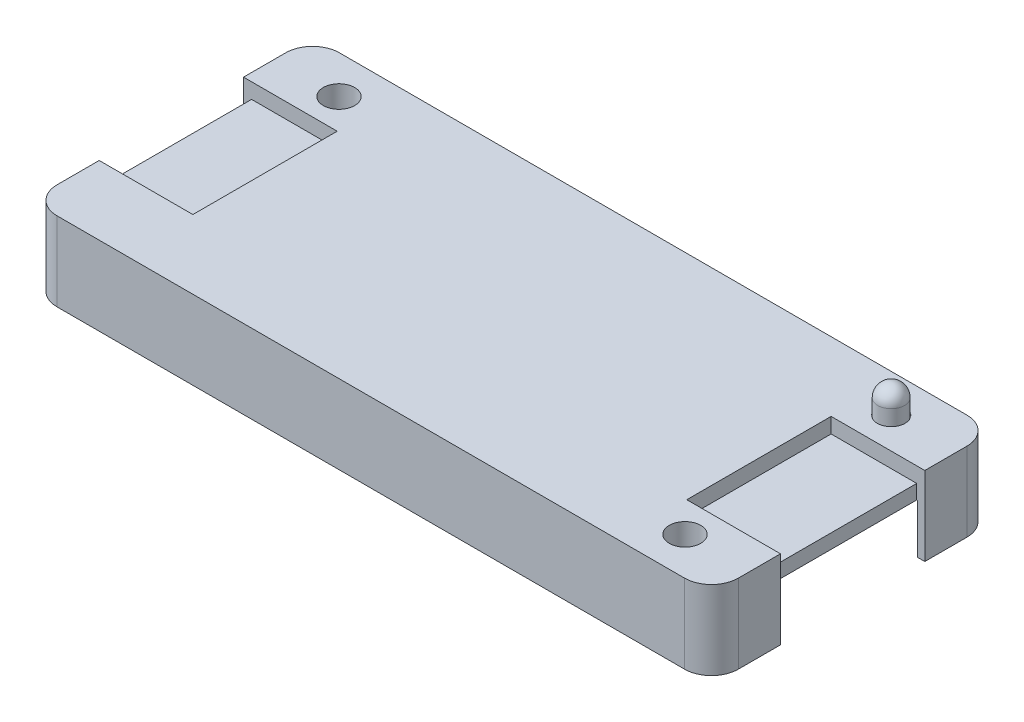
ISO-10303-21;
HEADER;
FILE_DESCRIPTION(('STEP AP214'),'2;1');
FILE_NAME('part.step','',(''),(''),'','','');
FILE_SCHEMA(('AUTOMOTIVE_DESIGN { 1 0 10303 214 1 1 1 1 }'));
ENDSEC;
DATA;
#1=APPLICATION_CONTEXT('core data for automotive mechanical design processes');
#2=APPLICATION_PROTOCOL_DEFINITION('international standard','automotive_design',2000,#1);
#3=PRODUCT_CONTEXT('',#1,'mechanical');
#4=PRODUCT('Part','Part','',(#3));
#5=PRODUCT_RELATED_PRODUCT_CATEGORY('part','',(#4));
#6=PRODUCT_DEFINITION_FORMATION('','',#4);
#7=PRODUCT_DEFINITION_CONTEXT('part definition',#1,'design');
#8=PRODUCT_DEFINITION('design','',#6,#7);
#9=PRODUCT_DEFINITION_SHAPE('','',#8);
#10=(LENGTH_UNIT() NAMED_UNIT(*) SI_UNIT(.MILLI.,.METRE.));
#11=(NAMED_UNIT(*) PLANE_ANGLE_UNIT() SI_UNIT($,.RADIAN.));
#12=(NAMED_UNIT(*) SI_UNIT($,.STERADIAN.) SOLID_ANGLE_UNIT());
#13=UNCERTAINTY_MEASURE_WITH_UNIT(LENGTH_MEASURE(1.E-05),#10,'distance_accuracy_value','');
#14=(GEOMETRIC_REPRESENTATION_CONTEXT(3) GLOBAL_UNCERTAINTY_ASSIGNED_CONTEXT((#13)) GLOBAL_UNIT_ASSIGNED_CONTEXT((#10,
#11,#12)) REPRESENTATION_CONTEXT('',''));
#15=CARTESIAN_POINT('',(0.,0.,0.));
#16=DIRECTION('',(0.,0.,1.));
#17=DIRECTION('',(1.,0.,0.));
#18=AXIS2_PLACEMENT_3D('',#15,#16,#17);
#19=CARTESIAN_POINT('',(30.8,12.,-11.5));
#20=DIRECTION('',(0.,-1.,0.));
#21=DIRECTION('',(0.,0.,-1.));
#22=AXIS2_PLACEMENT_3D('',#19,#20,#21);
#23=CYLINDRICAL_SURFACE('',#22,1.50000000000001);
#24=CARTESIAN_POINT('',(30.8,8.7,-11.5));
#25=DIRECTION('',(0.,1.,0.));
#26=DIRECTION('',(0.,0.,1.));
#27=AXIS2_PLACEMENT_3D('',#24,#25,#26);
#28=CIRCLE('',#27,1.50000000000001);
#29=CARTESIAN_POINT('',(30.8,8.7,-9.99999999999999));
#30=VERTEX_POINT('',#29);
#31=EDGE_CURVE('E27',#30,#30,#28,.T.);
#32=ORIENTED_EDGE('',*,*,#31,.T.);
#33=EDGE_LOOP('',(#32));
#34=FACE_BOUND('',#33,.T.);
#35=CARTESIAN_POINT('',(30.8,10.5,-11.5));
#36=DIRECTION('',(0.,-1.,0.));
#37=DIRECTION('',(0.,0.,-1.));
#38=AXIS2_PLACEMENT_3D('',#35,#36,#37);
#39=CIRCLE('',#38,1.50000000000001);
#40=CARTESIAN_POINT('',(30.8,10.5,-13.));
#41=VERTEX_POINT('',#40);
#42=EDGE_CURVE('E11',#41,#41,#39,.T.);
#43=ORIENTED_EDGE('',*,*,#42,.T.);
#44=EDGE_LOOP('',(#43));
#45=FACE_BOUND('',#44,.T.);
#46=ADVANCED_FACE('F17',(#34,#45),#23,.T.);
#47=CARTESIAN_POINT('',(30.8,8.7,-11.5));
#48=DIRECTION('',(0.,1.,0.));
#49=DIRECTION('',(0.,0.,1.));
#50=AXIS2_PLACEMENT_3D('',#47,#48,#49);
#51=CYLINDRICAL_SURFACE('',#50,1.55);
#52=CARTESIAN_POINT('',(30.8,8.8,-11.5));
#53=DIRECTION('',(0.,1.,0.));
#54=DIRECTION('',(0.,0.,1.));
#55=AXIS2_PLACEMENT_3D('',#52,#53,#54);
#56=CIRCLE('',#55,1.55);
#57=CARTESIAN_POINT('',(30.8,8.8,-9.95));
#58=VERTEX_POINT('',#57);
#59=EDGE_CURVE('E1421',#58,#58,#56,.T.);
#60=ORIENTED_EDGE('',*,*,#59,.T.);
#61=EDGE_LOOP('',(#60));
#62=FACE_BOUND('',#61,.T.);
#63=CARTESIAN_POINT('',(30.8,8.7,-11.5));
#64=DIRECTION('',(0.,1.,0.));
#65=DIRECTION('',(0.,0.,1.));
#66=AXIS2_PLACEMENT_3D('',#63,#64,#65);
#67=CIRCLE('',#66,1.55);
#68=CARTESIAN_POINT('',(30.8,8.7,-9.95));
#69=VERTEX_POINT('',#68);
#70=EDGE_CURVE('E1404',#69,#69,#67,.T.);
#71=ORIENTED_EDGE('',*,*,#70,.F.);
#72=EDGE_LOOP('',(#71));
#73=FACE_BOUND('',#72,.T.);
#74=ADVANCED_FACE('F811',(#62,#73),#51,.F.);
#75=CARTESIAN_POINT('',(30.8,8.8,11.5));
#76=DIRECTION('',(0.,-1.,0.));
#77=DIRECTION('',(0.,0.,-1.));
#78=AXIS2_PLACEMENT_3D('',#75,#76,#77);
#79=CYLINDRICAL_SURFACE('',#78,1.75);
#80=CARTESIAN_POINT('',(30.8,5.5,11.5));
#81=DIRECTION('',(0.,-1.,0.));
#82=DIRECTION('',(0.,0.,-1.));
#83=AXIS2_PLACEMENT_3D('',#80,#81,#82);
#84=CIRCLE('',#83,1.75);
#85=CARTESIAN_POINT('',(30.8,5.5,9.75));
#86=VERTEX_POINT('',#85);
#87=EDGE_CURVE('E1415',#86,#86,#84,.T.);
#88=ORIENTED_EDGE('',*,*,#87,.T.);
#89=EDGE_LOOP('',(#88));
#90=FACE_BOUND('',#89,.T.);
#91=CARTESIAN_POINT('',(30.8,8.8,11.5));
#92=DIRECTION('',(0.,1.,0.));
#93=DIRECTION('',(0.,0.,1.));
#94=AXIS2_PLACEMENT_3D('',#91,#92,#93);
#95=CIRCLE('',#94,1.75);
#96=CARTESIAN_POINT('',(30.8,8.8,13.25));
#97=VERTEX_POINT('',#96);
#98=EDGE_CURVE('E1418',#97,#97,#95,.T.);
#99=ORIENTED_EDGE('',*,*,#98,.T.);
#100=EDGE_LOOP('',(#99));
#101=FACE_BOUND('',#100,.T.);
#102=ADVANCED_FACE('F817',(#90,#101),#79,.F.);
#103=CARTESIAN_POINT('',(-30.8,8.8,-11.5));
#104=DIRECTION('',(0.,-1.,0.));
#105=DIRECTION('',(0.,0.,-1.));
#106=AXIS2_PLACEMENT_3D('',#103,#104,#105);
#107=CYLINDRICAL_SURFACE('',#106,1.75);
#108=CARTESIAN_POINT('',(-30.8,5.5,-11.5));
#109=DIRECTION('',(0.,-1.,0.));
#110=DIRECTION('',(0.,0.,-1.));
#111=AXIS2_PLACEMENT_3D('',#108,#109,#110);
#112=CIRCLE('',#111,1.75);
#113=CARTESIAN_POINT('',(-30.8,5.5,-13.25));
#114=VERTEX_POINT('',#113);
#115=EDGE_CURVE('E1409',#114,#114,#112,.T.);
#116=ORIENTED_EDGE('',*,*,#115,.T.);
#117=EDGE_LOOP('',(#116));
#118=FACE_BOUND('',#117,.T.);
#119=CARTESIAN_POINT('',(-30.8,8.8,-11.5));
#120=DIRECTION('',(0.,1.,0.));
#121=DIRECTION('',(0.,0.,1.));
#122=AXIS2_PLACEMENT_3D('',#119,#120,#121);
#123=CIRCLE('',#122,1.75);
#124=CARTESIAN_POINT('',(-30.8,8.8,-9.75));
#125=VERTEX_POINT('',#124);
#126=EDGE_CURVE('E1412',#125,#125,#123,.T.);
#127=ORIENTED_EDGE('',*,*,#126,.T.);
#128=EDGE_LOOP('',(#127));
#129=FACE_BOUND('',#128,.T.);
#130=ADVANCED_FACE('F825',(#118,#129),#107,.F.);
#131=CARTESIAN_POINT('',(30.8,8.7,-11.5));
#132=DIRECTION('',(0.,1.,0.));
#133=DIRECTION('',(0.,0.,1.));
#134=AXIS2_PLACEMENT_3D('',#131,#132,#133);
#135=PLANE('',#134);
#136=ORIENTED_EDGE('',*,*,#70,.T.);
#137=EDGE_LOOP('',(#136));
#138=FACE_BOUND('',#137,.T.);
#139=ORIENTED_EDGE('',*,*,#31,.F.);
#140=EDGE_LOOP('',(#139));
#141=FACE_BOUND('',#140,.T.);
#142=ADVANCED_FACE('F829',(#138,#141),#135,.T.);
#143=CARTESIAN_POINT('',(-27.55,8.8,-8.04999999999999));
#144=DIRECTION('',(1.,0.,0.));
#145=DIRECTION('',(0.,0.,-1.));
#146=AXIS2_PLACEMENT_3D('',#143,#144,#145);
#147=PLANE('',#146);
#148=DIRECTION('',(0.,0.,1.));
#149=VECTOR('',#148,1.);
#150=CARTESIAN_POINT('',(-27.55,7.1,-8.04999999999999));
#151=LINE('',#150,#149);
#152=CARTESIAN_POINT('',(-27.55,7.1,-8.04999999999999));
#153=VERTEX_POINT('',#152);
#154=CARTESIAN_POINT('',(-27.55,7.1,8.05000000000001));
#155=VERTEX_POINT('',#154);
#156=EDGE_CURVE('E1403',#153,#155,#151,.T.);
#157=ORIENTED_EDGE('',*,*,#156,.T.);
#158=DIRECTION('',(0.,-1.,0.));
#159=VECTOR('',#158,1.);
#160=CARTESIAN_POINT('',(-27.55,8.8,8.05000000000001));
#161=LINE('',#160,#159);
#162=CARTESIAN_POINT('',(-27.55,8.8,8.05000000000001));
#163=VERTEX_POINT('',#162);
#164=EDGE_CURVE('E36',#163,#155,#161,.T.);
#165=ORIENTED_EDGE('',*,*,#164,.F.);
#166=DIRECTION('',(0.,0.,1.));
#167=VECTOR('',#166,1.);
#168=CARTESIAN_POINT('',(-27.55,8.8,-8.04999999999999));
#169=LINE('',#168,#167);
#170=CARTESIAN_POINT('',(-27.55,8.8,-8.04999999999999));
#171=VERTEX_POINT('',#170);
#172=EDGE_CURVE('E703',#171,#163,#169,.T.);
#173=ORIENTED_EDGE('',*,*,#172,.F.);
#174=DIRECTION('',(0.,-1.,0.));
#175=VECTOR('',#174,1.);
#176=CARTESIAN_POINT('',(-27.55,8.8,-8.04999999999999));
#177=LINE('',#176,#175);
#178=EDGE_CURVE('E640',#171,#153,#177,.T.);
#179=ORIENTED_EDGE('',*,*,#178,.T.);
#180=EDGE_LOOP('',(#157,#165,#173,#179));
#181=FACE_BOUND('',#180,.T.);
#182=ADVANCED_FACE('F833',(#181),#147,.F.);
#183=CARTESIAN_POINT('',(-38.,0.,-8.04999999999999));
#184=DIRECTION('',(0.,-1.,0.));
#185=DIRECTION('',(0.,0.,-1.));
#186=AXIS2_PLACEMENT_3D('',#183,#184,#185);
#187=PLANE('',#186);
#188=DIRECTION('',(0.,0.,-1.));
#189=VECTOR('',#188,1.);
#190=CARTESIAN_POINT('',(-37.2,0.,12.75));
#191=LINE('',#190,#189);
#192=CARTESIAN_POINT('',(-37.2,0.,-8.04999999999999));
#193=VERTEX_POINT('',#192);
#194=CARTESIAN_POINT('',(-37.2,0.,-12.75));
#195=VERTEX_POINT('',#194);
#196=EDGE_CURVE('E421',#193,#195,#191,.T.);
#197=ORIENTED_EDGE('',*,*,#196,.F.);
#198=DIRECTION('',(1.,0.,0.));
#199=VECTOR('',#198,1.);
#200=CARTESIAN_POINT('',(-38.,0.,-8.04999999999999));
#201=LINE('',#200,#199);
#202=CARTESIAN_POINT('',(-38.,0.,-8.04999999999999));
#203=VERTEX_POINT('',#202);
#204=EDGE_CURVE('E372',#203,#193,#201,.T.);
#205=ORIENTED_EDGE('',*,*,#204,.F.);
#206=DIRECTION('',(0.,0.,1.));
#207=VECTOR('',#206,1.);
#208=CARTESIAN_POINT('',(-38.,0.,-8.04999999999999));
#209=LINE('',#208,#207);
#210=CARTESIAN_POINT('',(-38.,0.,-12.75));
#211=VERTEX_POINT('',#210);
#212=EDGE_CURVE('E367',#211,#203,#209,.T.);
#213=ORIENTED_EDGE('',*,*,#212,.F.);
#214=CARTESIAN_POINT('',(-35.,0.,-12.75));
#215=DIRECTION('',(0.,-1.,0.));
#216=DIRECTION('',(0.,0.,-1.));
#217=AXIS2_PLACEMENT_3D('',#214,#215,#216);
#218=CIRCLE('',#217,3.);
#219=CARTESIAN_POINT('',(-35.,0.,-15.75));
#220=VERTEX_POINT('',#219);
#221=EDGE_CURVE('E637',#211,#220,#218,.T.);
#222=ORIENTED_EDGE('',*,*,#221,.T.);
#223=DIRECTION('',(-1.,0.,0.));
#224=VECTOR('',#223,1.);
#225=CARTESIAN_POINT('',(38.,0.,-15.75));
#226=LINE('',#225,#224);
#227=CARTESIAN_POINT('',(35.,0.,-15.75));
#228=VERTEX_POINT('',#227);
#229=EDGE_CURVE('E620',#228,#220,#226,.T.);
#230=ORIENTED_EDGE('',*,*,#229,.F.);
#231=CARTESIAN_POINT('',(35.,0.,-12.75));
#232=DIRECTION('',(0.,-1.,0.));
#233=DIRECTION('',(0.,0.,-1.));
#234=AXIS2_PLACEMENT_3D('',#231,#232,#233);
#235=CIRCLE('',#234,3.);
#236=CARTESIAN_POINT('',(38.,0.,-12.75));
#237=VERTEX_POINT('',#236);
#238=EDGE_CURVE('E641',#228,#237,#235,.T.);
#239=ORIENTED_EDGE('',*,*,#238,.T.);
#240=DIRECTION('',(0.,0.,-1.));
#241=VECTOR('',#240,1.);
#242=CARTESIAN_POINT('',(38.,0.,-8.05));
#243=LINE('',#242,#241);
#244=CARTESIAN_POINT('',(38.,0.,-8.05));
#245=VERTEX_POINT('',#244);
#246=EDGE_CURVE('E617',#245,#237,#243,.T.);
#247=ORIENTED_EDGE('',*,*,#246,.F.);
#248=DIRECTION('',(1.,0.,0.));
#249=VECTOR('',#248,1.);
#250=CARTESIAN_POINT('',(27.55,0.,-8.05));
#251=LINE('',#250,#249);
#252=CARTESIAN_POINT('',(37.2,0.,-8.05));
#253=VERTEX_POINT('',#252);
#254=EDGE_CURVE('E609',#253,#245,#251,.T.);
#255=ORIENTED_EDGE('',*,*,#254,.F.);
#256=DIRECTION('',(0.,0.,1.));
#257=VECTOR('',#256,1.);
#258=CARTESIAN_POINT('',(37.2,0.,12.75));
#259=LINE('',#258,#257);
#260=CARTESIAN_POINT('',(37.2,0.,-12.75));
#261=VERTEX_POINT('',#260);
#262=EDGE_CURVE('E405',#261,#253,#259,.T.);
#263=ORIENTED_EDGE('',*,*,#262,.F.);
#264=CARTESIAN_POINT('',(35.,0.,-12.75));
#265=DIRECTION('',(0.,-1.,0.));
#266=DIRECTION('',(0.,0.,-1.));
#267=AXIS2_PLACEMENT_3D('',#264,#265,#266);
#268=CIRCLE('',#267,2.2);
#269=CARTESIAN_POINT('',(35.,0.,-14.95));
#270=VERTEX_POINT('',#269);
#271=EDGE_CURVE('E445',#270,#261,#268,.T.);
#272=ORIENTED_EDGE('',*,*,#271,.F.);
#273=DIRECTION('',(1.,0.,0.));
#274=VECTOR('',#273,1.);
#275=CARTESIAN_POINT('',(-35.,0.,-14.95));
#276=LINE('',#275,#274);
#277=CARTESIAN_POINT('',(25.7,0.,-14.95));
#278=VERTEX_POINT('',#277);
#279=EDGE_CURVE('E452',#278,#270,#276,.T.);
#280=ORIENTED_EDGE('',*,*,#279,.F.);
#281=DIRECTION('',(0.,0.,1.));
#282=VECTOR('',#281,1.);
#283=CARTESIAN_POINT('',(25.7,0.,-14.95));
#284=LINE('',#283,#282);
#285=CARTESIAN_POINT('',(25.7,0.,-14.15));
#286=VERTEX_POINT('',#285);
#287=EDGE_CURVE('E645',#278,#286,#284,.T.);
#288=ORIENTED_EDGE('',*,*,#287,.T.);
#289=DIRECTION('',(-1.,0.,0.));
#290=VECTOR('',#289,1.);
#291=CARTESIAN_POINT('',(25.7,0.,-14.15));
#292=LINE('',#291,#290);
#293=CARTESIAN_POINT('',(20.6,0.,-14.15));
#294=VERTEX_POINT('',#293);
#295=EDGE_CURVE('E655',#286,#294,#292,.T.);
#296=ORIENTED_EDGE('',*,*,#295,.T.);
#297=DIRECTION('',(0.,0.,-1.));
#298=VECTOR('',#297,1.);
#299=CARTESIAN_POINT('',(20.6,0.,-14.95));
#300=LINE('',#299,#298);
#301=CARTESIAN_POINT('',(20.6,0.,-14.95));
#302=VERTEX_POINT('',#301);
#303=EDGE_CURVE('E658',#294,#302,#300,.T.);
#304=ORIENTED_EDGE('',*,*,#303,.T.);
#305=DIRECTION('',(1.,0.,0.));
#306=VECTOR('',#305,1.);
#307=CARTESIAN_POINT('',(-35.,0.,-14.95));
#308=LINE('',#307,#306);
#309=CARTESIAN_POINT('',(-20.6,0.,-14.95));
#310=VERTEX_POINT('',#309);
#311=EDGE_CURVE('E467',#310,#302,#308,.T.);
#312=ORIENTED_EDGE('',*,*,#311,.F.);
#313=DIRECTION('',(0.,0.,1.));
#314=VECTOR('',#313,1.);
#315=CARTESIAN_POINT('',(-20.6,0.,-14.95));
#316=LINE('',#315,#314);
#317=CARTESIAN_POINT('',(-20.6,0.,-14.15));
#318=VERTEX_POINT('',#317);
#319=EDGE_CURVE('E661',#310,#318,#316,.T.);
#320=ORIENTED_EDGE('',*,*,#319,.T.);
#321=DIRECTION('',(-1.,0.,0.));
#322=VECTOR('',#321,1.);
#323=CARTESIAN_POINT('',(-25.7,0.,-14.15));
#324=LINE('',#323,#322);
#325=CARTESIAN_POINT('',(-25.7,0.,-14.15));
#326=VERTEX_POINT('',#325);
#327=EDGE_CURVE('E665',#318,#326,#324,.T.);
#328=ORIENTED_EDGE('',*,*,#327,.T.);
#329=DIRECTION('',(0.,0.,-1.));
#330=VECTOR('',#329,1.);
#331=CARTESIAN_POINT('',(-25.7,0.,-14.95));
#332=LINE('',#331,#330);
#333=CARTESIAN_POINT('',(-25.7,0.,-14.95));
#334=VERTEX_POINT('',#333);
#335=EDGE_CURVE('E668',#326,#334,#332,.T.);
#336=ORIENTED_EDGE('',*,*,#335,.T.);
#337=DIRECTION('',(1.,0.,0.));
#338=VECTOR('',#337,1.);
#339=CARTESIAN_POINT('',(-35.,0.,-14.95));
#340=LINE('',#339,#338);
#341=CARTESIAN_POINT('',(-35.,0.,-14.95));
#342=VERTEX_POINT('',#341);
#343=EDGE_CURVE('E456',#342,#334,#340,.T.);
#344=ORIENTED_EDGE('',*,*,#343,.F.);
#345=CARTESIAN_POINT('',(-35.,0.,-12.75));
#346=DIRECTION('',(0.,-1.,0.));
#347=DIRECTION('',(0.,0.,-1.));
#348=AXIS2_PLACEMENT_3D('',#345,#346,#347);
#349=CIRCLE('',#348,2.2);
#350=EDGE_CURVE('E409',#195,#342,#349,.T.);
#351=ORIENTED_EDGE('',*,*,#350,.F.);
#352=EDGE_LOOP('',(#197,#205,#213,#222,#230,#239,#247,#255,#263,#272,#280,#288,#296,#304,#312,
#320,#328,#336,#344,#351));
#353=FACE_BOUND('',#352,.T.);
#354=ADVANCED_FACE('F837',(#353),#187,.T.);
#355=CARTESIAN_POINT('',(27.55,8.8,8.05));
#356=DIRECTION('',(-1.,0.,0.));
#357=DIRECTION('',(0.,0.,1.));
#358=AXIS2_PLACEMENT_3D('',#355,#356,#357);
#359=PLANE('',#358);
#360=DIRECTION('',(0.,-1.,0.));
#361=VECTOR('',#360,1.);
#362=CARTESIAN_POINT('',(27.55,8.8,8.05));
#363=LINE('',#362,#361);
#364=CARTESIAN_POINT('',(27.55,8.8,8.05));
#365=VERTEX_POINT('',#364);
#366=CARTESIAN_POINT('',(27.55,7.1,8.05));
#367=VERTEX_POINT('',#366);
#368=EDGE_CURVE('E671',#365,#367,#363,.T.);
#369=ORIENTED_EDGE('',*,*,#368,.T.);
#370=DIRECTION('',(0.,0.,-1.));
#371=VECTOR('',#370,1.);
#372=CARTESIAN_POINT('',(27.55,7.1,-8.05));
#373=LINE('',#372,#371);
#374=CARTESIAN_POINT('',(27.55,7.1,-8.05));
#375=VERTEX_POINT('',#374);
#376=EDGE_CURVE('E676',#367,#375,#373,.T.);
#377=ORIENTED_EDGE('',*,*,#376,.T.);
#378=DIRECTION('',(0.,-1.,0.));
#379=VECTOR('',#378,1.);
#380=CARTESIAN_POINT('',(27.55,8.8,-8.05));
#381=LINE('',#380,#379);
#382=CARTESIAN_POINT('',(27.55,8.8,-8.05));
#383=VERTEX_POINT('',#382);
#384=EDGE_CURVE('E647',#383,#375,#381,.T.);
#385=ORIENTED_EDGE('',*,*,#384,.F.);
#386=DIRECTION('',(0.,0.,-1.));
#387=VECTOR('',#386,1.);
#388=CARTESIAN_POINT('',(27.55,8.8,8.05));
#389=LINE('',#388,#387);
#390=EDGE_CURVE('E681',#365,#383,#389,.T.);
#391=ORIENTED_EDGE('',*,*,#390,.F.);
#392=EDGE_LOOP('',(#369,#377,#385,#391));
#393=FACE_BOUND('',#392,.T.);
#394=ADVANCED_FACE('F841',(#393),#359,.F.);
#395=CARTESIAN_POINT('',(-38.,8.8,-8.04999999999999));
#396=DIRECTION('',(0.,-1.,0.));
#397=DIRECTION('',(0.,0.,-1.));
#398=AXIS2_PLACEMENT_3D('',#395,#396,#397);
#399=PLANE('',#398);
#400=ORIENTED_EDGE('',*,*,#59,.F.);
#401=EDGE_LOOP('',(#400));
#402=FACE_BOUND('',#401,.T.);
#403=ORIENTED_EDGE('',*,*,#126,.F.);
#404=EDGE_LOOP('',(#403));
#405=FACE_BOUND('',#404,.T.);
#406=DIRECTION('',(0.,0.,-1.));
#407=VECTOR('',#406,1.);
#408=CARTESIAN_POINT('',(38.,8.8,-8.05));
#409=LINE('',#408,#407);
#410=CARTESIAN_POINT('',(38.,8.8,-8.05));
#411=VERTEX_POINT('',#410);
#412=CARTESIAN_POINT('',(38.,8.8,-12.75));
#413=VERTEX_POINT('',#412);
#414=EDGE_CURVE('E679',#411,#413,#409,.T.);
#415=ORIENTED_EDGE('',*,*,#414,.T.);
#416=CARTESIAN_POINT('',(35.,8.8,-12.75));
#417=DIRECTION('',(0.,1.,0.));
#418=DIRECTION('',(0.,0.,-1.));
#419=AXIS2_PLACEMENT_3D('',#416,#417,#418);
#420=CIRCLE('',#419,3.);
#421=CARTESIAN_POINT('',(35.,8.8,-15.75));
#422=VERTEX_POINT('',#421);
#423=EDGE_CURVE('E688',#413,#422,#420,.T.);
#424=ORIENTED_EDGE('',*,*,#423,.T.);
#425=DIRECTION('',(-1.,0.,0.));
#426=VECTOR('',#425,1.);
#427=CARTESIAN_POINT('',(38.,8.8,-15.75));
#428=LINE('',#427,#426);
#429=CARTESIAN_POINT('',(-35.,8.8,-15.75));
#430=VERTEX_POINT('',#429);
#431=EDGE_CURVE('E691',#422,#430,#428,.T.);
#432=ORIENTED_EDGE('',*,*,#431,.T.);
#433=CARTESIAN_POINT('',(-35.,8.8,-12.75));
#434=DIRECTION('',(0.,1.,0.));
#435=DIRECTION('',(0.,0.,-1.));
#436=AXIS2_PLACEMENT_3D('',#433,#434,#435);
#437=CIRCLE('',#436,3.);
#438=CARTESIAN_POINT('',(-38.,8.8,-12.75));
#439=VERTEX_POINT('',#438);
#440=EDGE_CURVE('E694',#430,#439,#437,.T.);
#441=ORIENTED_EDGE('',*,*,#440,.T.);
#442=DIRECTION('',(0.,0.,1.));
#443=VECTOR('',#442,1.);
#444=CARTESIAN_POINT('',(-38.,8.8,-8.04999999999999));
#445=LINE('',#444,#443);
#446=CARTESIAN_POINT('',(-38.,8.8,-8.04999999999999));
#447=VERTEX_POINT('',#446);
#448=EDGE_CURVE('E697',#439,#447,#445,.T.);
#449=ORIENTED_EDGE('',*,*,#448,.T.);
#450=DIRECTION('',(1.,0.,0.));
#451=VECTOR('',#450,1.);
#452=CARTESIAN_POINT('',(-38.,8.8,-8.04999999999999));
#453=LINE('',#452,#451);
#454=EDGE_CURVE('E700',#447,#171,#453,.T.);
#455=ORIENTED_EDGE('',*,*,#454,.T.);
#456=ORIENTED_EDGE('',*,*,#172,.T.);
#457=DIRECTION('',(-1.,0.,0.));
#458=VECTOR('',#457,1.);
#459=CARTESIAN_POINT('',(-27.55,8.8,8.05000000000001));
#460=LINE('',#459,#458);
#461=CARTESIAN_POINT('',(-38.,8.8,8.05000000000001));
#462=VERTEX_POINT('',#461);
#463=EDGE_CURVE('E704',#163,#462,#460,.T.);
#464=ORIENTED_EDGE('',*,*,#463,.T.);
#465=DIRECTION('',(0.,0.,1.));
#466=VECTOR('',#465,1.);
#467=CARTESIAN_POINT('',(-38.,8.8,15.75));
#468=LINE('',#467,#466);
#469=CARTESIAN_POINT('',(-38.,8.8,12.75));
#470=VERTEX_POINT('',#469);
#471=EDGE_CURVE('E707',#462,#470,#468,.T.);
#472=ORIENTED_EDGE('',*,*,#471,.T.);
#473=CARTESIAN_POINT('',(-35.,8.8,12.75));
#474=DIRECTION('',(0.,1.,0.));
#475=DIRECTION('',(0.,0.,-1.));
#476=AXIS2_PLACEMENT_3D('',#473,#474,#475);
#477=CIRCLE('',#476,3.);
#478=CARTESIAN_POINT('',(-35.,8.8,15.75));
#479=VERTEX_POINT('',#478);
#480=EDGE_CURVE('E710',#470,#479,#477,.T.);
#481=ORIENTED_EDGE('',*,*,#480,.T.);
#482=DIRECTION('',(1.,0.,0.));
#483=VECTOR('',#482,1.);
#484=CARTESIAN_POINT('',(-38.,8.8,15.75));
#485=LINE('',#484,#483);
#486=CARTESIAN_POINT('',(35.,8.8,15.75));
#487=VERTEX_POINT('',#486);
#488=EDGE_CURVE('E713',#479,#487,#485,.T.);
#489=ORIENTED_EDGE('',*,*,#488,.T.);
#490=CARTESIAN_POINT('',(35.,8.8,12.75));
#491=DIRECTION('',(0.,1.,0.));
#492=DIRECTION('',(0.,0.,-1.));
#493=AXIS2_PLACEMENT_3D('',#490,#491,#492);
#494=CIRCLE('',#493,3.);
#495=CARTESIAN_POINT('',(38.,8.8,12.75));
#496=VERTEX_POINT('',#495);
#497=EDGE_CURVE('E716',#487,#496,#494,.T.);
#498=ORIENTED_EDGE('',*,*,#497,.T.);
#499=DIRECTION('',(0.,0.,-1.));
#500=VECTOR('',#499,1.);
#501=CARTESIAN_POINT('',(38.,8.8,15.75));
#502=LINE('',#501,#500);
#503=CARTESIAN_POINT('',(38.,8.8,8.05));
#504=VERTEX_POINT('',#503);
#505=EDGE_CURVE('E719',#496,#504,#502,.T.);
#506=ORIENTED_EDGE('',*,*,#505,.T.);
#507=DIRECTION('',(-1.,0.,0.));
#508=VECTOR('',#507,1.);
#509=CARTESIAN_POINT('',(38.,8.8,8.05));
#510=LINE('',#509,#508);
#511=EDGE_CURVE('E684',#504,#365,#510,.T.);
#512=ORIENTED_EDGE('',*,*,#511,.T.);
#513=ORIENTED_EDGE('',*,*,#390,.T.);
#514=DIRECTION('',(1.,0.,0.));
#515=VECTOR('',#514,1.);
#516=CARTESIAN_POINT('',(27.55,8.8,-8.05));
#517=LINE('',#516,#515);
#518=EDGE_CURVE('E685',#383,#411,#517,.T.);
#519=ORIENTED_EDGE('',*,*,#518,.T.);
#520=EDGE_LOOP('',(#415,#424,#432,#441,#449,#455,#456,#464,#472,#481,#489,#498,#506,#512,#513,#519));
#521=FACE_BOUND('',#520,.T.);
#522=ORIENTED_EDGE('',*,*,#98,.F.);
#523=EDGE_LOOP('',(#522));
#524=FACE_BOUND('',#523,.T.);
#525=ADVANCED_FACE('F786',(#402,#405,#521,#524),#399,.F.);
#526=CARTESIAN_POINT('',(-38.,0.,-8.04999999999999));
#527=DIRECTION('',(0.,-1.,0.));
#528=DIRECTION('',(0.,0.,-1.));
#529=AXIS2_PLACEMENT_3D('',#526,#527,#528);
#530=PLANE('',#529);
#531=DIRECTION('',(0.,0.,-1.));
#532=VECTOR('',#531,1.);
#533=CARTESIAN_POINT('',(-37.2,0.,12.75));
#534=LINE('',#533,#532);
#535=CARTESIAN_POINT('',(-37.2,0.,12.75));
#536=VERTEX_POINT('',#535);
#537=CARTESIAN_POINT('',(-37.2,0.,8.05000000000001));
#538=VERTEX_POINT('',#537);
#539=EDGE_CURVE('E422',#536,#538,#534,.T.);
#540=ORIENTED_EDGE('',*,*,#539,.F.);
#541=CARTESIAN_POINT('',(-35.,0.,12.75));
#542=DIRECTION('',(0.,-1.,0.));
#543=DIRECTION('',(0.,0.,-1.));
#544=AXIS2_PLACEMENT_3D('',#541,#542,#543);
#545=CIRCLE('',#544,2.2);
#546=CARTESIAN_POINT('',(-35.,0.,14.95));
#547=VERTEX_POINT('',#546);
#548=EDGE_CURVE('E410',#547,#536,#545,.T.);
#549=ORIENTED_EDGE('',*,*,#548,.F.);
#550=DIRECTION('',(-1.,0.,0.));
#551=VECTOR('',#550,1.);
#552=CARTESIAN_POINT('',(-35.,0.,14.95));
#553=LINE('',#552,#551);
#554=CARTESIAN_POINT('',(-25.7,0.,14.95));
#555=VERTEX_POINT('',#554);
#556=EDGE_CURVE('E494',#555,#547,#553,.T.);
#557=ORIENTED_EDGE('',*,*,#556,.F.);
#558=DIRECTION('',(0.,0.,-1.));
#559=VECTOR('',#558,1.);
#560=CARTESIAN_POINT('',(-25.7,0.,14.95));
#561=LINE('',#560,#559);
#562=CARTESIAN_POINT('',(-25.7,0.,14.15));
#563=VERTEX_POINT('',#562);
#564=EDGE_CURVE('E725',#555,#563,#561,.T.);
#565=ORIENTED_EDGE('',*,*,#564,.T.);
#566=DIRECTION('',(1.,0.,0.));
#567=VECTOR('',#566,1.);
#568=CARTESIAN_POINT('',(-25.7,0.,14.15));
#569=LINE('',#568,#567);
#570=CARTESIAN_POINT('',(-20.6,0.,14.15));
#571=VERTEX_POINT('',#570);
#572=EDGE_CURVE('E731',#563,#571,#569,.T.);
#573=ORIENTED_EDGE('',*,*,#572,.T.);
#574=DIRECTION('',(0.,0.,1.));
#575=VECTOR('',#574,1.);
#576=CARTESIAN_POINT('',(-20.6,0.,14.95));
#577=LINE('',#576,#575);
#578=CARTESIAN_POINT('',(-20.6,0.,14.95));
#579=VERTEX_POINT('',#578);
#580=EDGE_CURVE('E734',#571,#579,#577,.T.);
#581=ORIENTED_EDGE('',*,*,#580,.T.);
#582=DIRECTION('',(-1.,0.,0.));
#583=VECTOR('',#582,1.);
#584=CARTESIAN_POINT('',(-35.,0.,14.95));
#585=LINE('',#584,#583);
#586=CARTESIAN_POINT('',(20.6,0.,14.95));
#587=VERTEX_POINT('',#586);
#588=EDGE_CURVE('E482',#587,#579,#585,.T.);
#589=ORIENTED_EDGE('',*,*,#588,.F.);
#590=DIRECTION('',(0.,0.,-1.));
#591=VECTOR('',#590,1.);
#592=CARTESIAN_POINT('',(20.6,0.,14.95));
#593=LINE('',#592,#591);
#594=CARTESIAN_POINT('',(20.6,0.,14.15));
#595=VERTEX_POINT('',#594);
#596=EDGE_CURVE('E550',#587,#595,#593,.T.);
#597=ORIENTED_EDGE('',*,*,#596,.T.);
#598=DIRECTION('',(1.,0.,0.));
#599=VECTOR('',#598,1.);
#600=CARTESIAN_POINT('',(25.7,0.,14.15));
#601=LINE('',#600,#599);
#602=CARTESIAN_POINT('',(25.7,0.,14.15));
#603=VERTEX_POINT('',#602);
#604=EDGE_CURVE('E330',#595,#603,#601,.T.);
#605=ORIENTED_EDGE('',*,*,#604,.T.);
#606=DIRECTION('',(0.,0.,1.));
#607=VECTOR('',#606,1.);
#608=CARTESIAN_POINT('',(25.7,0.,14.95));
#609=LINE('',#608,#607);
#610=CARTESIAN_POINT('',(25.7,0.,14.95));
#611=VERTEX_POINT('',#610);
#612=EDGE_CURVE('E539',#603,#611,#609,.T.);
#613=ORIENTED_EDGE('',*,*,#612,.T.);
#614=DIRECTION('',(-1.,0.,0.));
#615=VECTOR('',#614,1.);
#616=CARTESIAN_POINT('',(-35.,0.,14.95));
#617=LINE('',#616,#615);
#618=CARTESIAN_POINT('',(35.,0.,14.95));
#619=VERTEX_POINT('',#618);
#620=EDGE_CURVE('E476',#619,#611,#617,.T.);
#621=ORIENTED_EDGE('',*,*,#620,.F.);
#622=CARTESIAN_POINT('',(35.,0.,12.75));
#623=DIRECTION('',(0.,-1.,0.));
#624=DIRECTION('',(0.,0.,-1.));
#625=AXIS2_PLACEMENT_3D('',#622,#623,#624);
#626=CIRCLE('',#625,2.2);
#627=CARTESIAN_POINT('',(37.2,0.,12.75));
#628=VERTEX_POINT('',#627);
#629=EDGE_CURVE('E389',#628,#619,#626,.T.);
#630=ORIENTED_EDGE('',*,*,#629,.F.);
#631=DIRECTION('',(0.,0.,1.));
#632=VECTOR('',#631,1.);
#633=CARTESIAN_POINT('',(37.2,0.,12.75));
#634=LINE('',#633,#632);
#635=CARTESIAN_POINT('',(37.2,0.,8.05));
#636=VERTEX_POINT('',#635);
#637=EDGE_CURVE('E404',#636,#628,#634,.T.);
#638=ORIENTED_EDGE('',*,*,#637,.F.);
#639=DIRECTION('',(-1.,0.,0.));
#640=VECTOR('',#639,1.);
#641=CARTESIAN_POINT('',(38.,0.,8.05));
#642=LINE('',#641,#640);
#643=CARTESIAN_POINT('',(38.,0.,8.05));
#644=VERTEX_POINT('',#643);
#645=EDGE_CURVE('E560',#644,#636,#642,.T.);
#646=ORIENTED_EDGE('',*,*,#645,.F.);
#647=DIRECTION('',(0.,0.,-1.));
#648=VECTOR('',#647,1.);
#649=CARTESIAN_POINT('',(38.,0.,15.75));
#650=LINE('',#649,#648);
#651=CARTESIAN_POINT('',(38.,0.,12.75));
#652=VERTEX_POINT('',#651);
#653=EDGE_CURVE('E565',#652,#644,#650,.T.);
#654=ORIENTED_EDGE('',*,*,#653,.F.);
#655=CARTESIAN_POINT('',(35.,0.,12.75));
#656=DIRECTION('',(0.,-1.,0.));
#657=DIRECTION('',(0.,0.,-1.));
#658=AXIS2_PLACEMENT_3D('',#655,#656,#657);
#659=CIRCLE('',#658,3.);
#660=CARTESIAN_POINT('',(35.,0.,15.75));
#661=VERTEX_POINT('',#660);
#662=EDGE_CURVE('E548',#652,#661,#659,.T.);
#663=ORIENTED_EDGE('',*,*,#662,.T.);
#664=DIRECTION('',(1.,0.,0.));
#665=VECTOR('',#664,1.);
#666=CARTESIAN_POINT('',(-38.,0.,15.75));
#667=LINE('',#666,#665);
#668=CARTESIAN_POINT('',(-35.,0.,15.75));
#669=VERTEX_POINT('',#668);
#670=EDGE_CURVE('E570',#669,#661,#667,.T.);
#671=ORIENTED_EDGE('',*,*,#670,.F.);
#672=CARTESIAN_POINT('',(-35.,0.,12.75));
#673=DIRECTION('',(0.,-1.,0.));
#674=DIRECTION('',(0.,0.,-1.));
#675=AXIS2_PLACEMENT_3D('',#672,#673,#674);
#676=CIRCLE('',#675,3.);
#677=CARTESIAN_POINT('',(-38.,0.,12.75));
#678=VERTEX_POINT('',#677);
#679=EDGE_CURVE('E553',#669,#678,#676,.T.);
#680=ORIENTED_EDGE('',*,*,#679,.T.);
#681=DIRECTION('',(0.,0.,1.));
#682=VECTOR('',#681,1.);
#683=CARTESIAN_POINT('',(-38.,0.,15.75));
#684=LINE('',#683,#682);
#685=CARTESIAN_POINT('',(-38.,0.,8.05000000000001));
#686=VERTEX_POINT('',#685);
#687=EDGE_CURVE('E576',#686,#678,#684,.T.);
#688=ORIENTED_EDGE('',*,*,#687,.F.);
#689=DIRECTION('',(-1.,0.,0.));
#690=VECTOR('',#689,1.);
#691=CARTESIAN_POINT('',(-27.55,0.,8.05000000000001));
#692=LINE('',#691,#690);
#693=EDGE_CURVE('E385',#538,#686,#692,.T.);
#694=ORIENTED_EDGE('',*,*,#693,.F.);
#695=EDGE_LOOP('',(#540,#549,#557,#565,#573,#581,#589,#597,#605,#613,#621,#630,#638,#646,#654,
#663,#671,#680,#688,#694));
#696=FACE_BOUND('',#695,.T.);
#697=ADVANCED_FACE('F547',(#696),#530,.T.);
#698=CARTESIAN_POINT('',(-38.,8.8,15.75));
#699=DIRECTION('',(1.,0.,0.));
#700=DIRECTION('',(0.,0.,-1.));
#701=AXIS2_PLACEMENT_3D('',#698,#699,#700);
#702=PLANE('',#701);
#703=ORIENTED_EDGE('',*,*,#687,.T.);
#704=DIRECTION('',(0.,1.,0.));
#705=VECTOR('',#704,1.);
#706=CARTESIAN_POINT('',(-38.,8.8,12.75));
#707=LINE('',#706,#705);
#708=EDGE_CURVE('E578',#678,#470,#707,.T.);
#709=ORIENTED_EDGE('',*,*,#708,.T.);
#710=ORIENTED_EDGE('',*,*,#471,.F.);
#711=DIRECTION('',(0.,-1.,0.));
#712=VECTOR('',#711,1.);
#713=CARTESIAN_POINT('',(-38.,8.8,8.05000000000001));
#714=LINE('',#713,#712);
#715=EDGE_CURVE('E572',#462,#686,#714,.T.);
#716=ORIENTED_EDGE('',*,*,#715,.T.);
#717=EDGE_LOOP('',(#703,#709,#710,#716));
#718=FACE_BOUND('',#717,.T.);
#719=ADVANCED_FACE('F791',(#718),#702,.F.);
#720=CARTESIAN_POINT('',(-38.,8.8,15.75));
#721=DIRECTION('',(0.,0.,-1.));
#722=DIRECTION('',(-1.,0.,0.));
#723=AXIS2_PLACEMENT_3D('',#720,#721,#722);
#724=PLANE('',#723);
#725=ORIENTED_EDGE('',*,*,#670,.T.);
#726=DIRECTION('',(0.,1.,0.));
#727=VECTOR('',#726,1.);
#728=CARTESIAN_POINT('',(35.,8.8,15.75));
#729=LINE('',#728,#727);
#730=EDGE_CURVE('E573',#661,#487,#729,.T.);
#731=ORIENTED_EDGE('',*,*,#730,.T.);
#732=ORIENTED_EDGE('',*,*,#488,.F.);
#733=DIRECTION('',(0.,-1.,0.));
#734=VECTOR('',#733,1.);
#735=CARTESIAN_POINT('',(-35.,8.8,15.75));
#736=LINE('',#735,#734);
#737=EDGE_CURVE('E586',#479,#669,#736,.T.);
#738=ORIENTED_EDGE('',*,*,#737,.T.);
#739=EDGE_LOOP('',(#725,#731,#732,#738));
#740=FACE_BOUND('',#739,.T.);
#741=ADVANCED_FACE('F784',(#740),#724,.F.);
#742=CARTESIAN_POINT('',(38.,8.8,15.75));
#743=DIRECTION('',(-1.,0.,0.));
#744=DIRECTION('',(0.,0.,1.));
#745=AXIS2_PLACEMENT_3D('',#742,#743,#744);
#746=PLANE('',#745);
#747=ORIENTED_EDGE('',*,*,#505,.F.);
#748=DIRECTION('',(0.,-1.,0.));
#749=VECTOR('',#748,1.);
#750=CARTESIAN_POINT('',(38.,8.8,12.75));
#751=LINE('',#750,#749);
#752=EDGE_CURVE('E567',#496,#652,#751,.T.);
#753=ORIENTED_EDGE('',*,*,#752,.T.);
#754=ORIENTED_EDGE('',*,*,#653,.T.);
#755=DIRECTION('',(0.,-1.,0.));
#756=VECTOR('',#755,1.);
#757=CARTESIAN_POINT('',(38.,8.8,8.05));
#758=LINE('',#757,#756);
#759=EDGE_CURVE('E563',#504,#644,#758,.T.);
#760=ORIENTED_EDGE('',*,*,#759,.F.);
#761=EDGE_LOOP('',(#747,#753,#754,#760));
#762=FACE_BOUND('',#761,.T.);
#763=ADVANCED_FACE('F772',(#762),#746,.F.);
#764=CARTESIAN_POINT('',(38.,8.8,8.05));
#765=DIRECTION('',(0.,0.,1.));
#766=DIRECTION('',(1.,0.,0.));
#767=AXIS2_PLACEMENT_3D('',#764,#765,#766);
#768=PLANE('',#767);
#769=DIRECTION('',(1.,0.,0.));
#770=VECTOR('',#769,1.);
#771=CARTESIAN_POINT('',(38.,5.5,8.05));
#772=LINE('',#771,#770);
#773=CARTESIAN_POINT('',(37.1,5.5,8.05));
#774=VERTEX_POINT('',#773);
#775=CARTESIAN_POINT('',(37.2,5.5,8.05));
#776=VERTEX_POINT('',#775);
#777=EDGE_CURVE('E394',#774,#776,#772,.T.);
#778=ORIENTED_EDGE('',*,*,#777,.F.);
#779=DIRECTION('',(0.,-1.,0.));
#780=VECTOR('',#779,1.);
#781=CARTESIAN_POINT('',(37.1,7.1,8.05));
#782=LINE('',#781,#780);
#783=CARTESIAN_POINT('',(37.1,7.1,8.05));
#784=VERTEX_POINT('',#783);
#785=EDGE_CURVE('E359',#784,#774,#782,.T.);
#786=ORIENTED_EDGE('',*,*,#785,.F.);
#787=DIRECTION('',(-1.,0.,0.));
#788=VECTOR('',#787,1.);
#789=CARTESIAN_POINT('',(27.55,7.1,8.05));
#790=LINE('',#789,#788);
#791=EDGE_CURVE('E568',#784,#367,#790,.T.);
#792=ORIENTED_EDGE('',*,*,#791,.T.);
#793=ORIENTED_EDGE('',*,*,#368,.F.);
#794=ORIENTED_EDGE('',*,*,#511,.F.);
#795=ORIENTED_EDGE('',*,*,#759,.T.);
#796=ORIENTED_EDGE('',*,*,#645,.T.);
#797=DIRECTION('',(0.,1.,0.));
#798=VECTOR('',#797,1.);
#799=CARTESIAN_POINT('',(37.2,8.8,8.05));
#800=LINE('',#799,#798);
#801=EDGE_CURVE('E564',#636,#776,#800,.T.);
#802=ORIENTED_EDGE('',*,*,#801,.T.);
#803=EDGE_LOOP('',(#778,#786,#792,#793,#794,#795,#796,#802));
#804=FACE_BOUND('',#803,.T.);
#805=ADVANCED_FACE('F768',(#804),#768,.F.);
#806=CARTESIAN_POINT('',(27.55,8.8,-8.05));
#807=DIRECTION('',(0.,0.,-1.));
#808=DIRECTION('',(-1.,0.,0.));
#809=AXIS2_PLACEMENT_3D('',#806,#807,#808);
#810=PLANE('',#809);
#811=DIRECTION('',(1.,0.,0.));
#812=VECTOR('',#811,1.);
#813=CARTESIAN_POINT('',(27.55,7.1,-8.05));
#814=LINE('',#813,#812);
#815=CARTESIAN_POINT('',(37.1,7.1,-8.05));
#816=VERTEX_POINT('',#815);
#817=EDGE_CURVE('E599',#375,#816,#814,.T.);
#818=ORIENTED_EDGE('',*,*,#817,.T.);
#819=DIRECTION('',(0.,-1.,0.));
#820=VECTOR('',#819,1.);
#821=CARTESIAN_POINT('',(37.1,7.1,-8.05));
#822=LINE('',#821,#820);
#823=CARTESIAN_POINT('',(37.1,5.5,-8.05));
#824=VERTEX_POINT('',#823);
#825=EDGE_CURVE('E602',#816,#824,#822,.T.);
#826=ORIENTED_EDGE('',*,*,#825,.T.);
#827=DIRECTION('',(-1.,0.,0.));
#828=VECTOR('',#827,1.);
#829=CARTESIAN_POINT('',(27.55,5.5,-8.05));
#830=LINE('',#829,#828);
#831=CARTESIAN_POINT('',(37.2,5.5,-8.05));
#832=VERTEX_POINT('',#831);
#833=EDGE_CURVE('E400',#832,#824,#830,.T.);
#834=ORIENTED_EDGE('',*,*,#833,.F.);
#835=DIRECTION('',(0.,-1.,0.));
#836=VECTOR('',#835,1.);
#837=CARTESIAN_POINT('',(37.2,8.8,-8.05));
#838=LINE('',#837,#836);
#839=EDGE_CURVE('E605',#832,#253,#838,.T.);
#840=ORIENTED_EDGE('',*,*,#839,.T.);
#841=ORIENTED_EDGE('',*,*,#254,.T.);
#842=DIRECTION('',(0.,-1.,0.));
#843=VECTOR('',#842,1.);
#844=CARTESIAN_POINT('',(38.,8.8,-8.05));
#845=LINE('',#844,#843);
#846=EDGE_CURVE('E610',#411,#245,#845,.T.);
#847=ORIENTED_EDGE('',*,*,#846,.F.);
#848=ORIENTED_EDGE('',*,*,#518,.F.);
#849=ORIENTED_EDGE('',*,*,#384,.T.);
#850=EDGE_LOOP('',(#818,#826,#834,#840,#841,#847,#848,#849));
#851=FACE_BOUND('',#850,.T.);
#852=ADVANCED_FACE('F859',(#851),#810,.F.);
#853=CARTESIAN_POINT('',(38.,8.8,-8.05));
#854=DIRECTION('',(-1.,0.,0.));
#855=DIRECTION('',(0.,0.,1.));
#856=AXIS2_PLACEMENT_3D('',#853,#854,#855);
#857=PLANE('',#856);
#858=ORIENTED_EDGE('',*,*,#246,.T.);
#859=DIRECTION('',(0.,1.,0.));
#860=VECTOR('',#859,1.);
#861=CARTESIAN_POINT('',(38.,8.8,-12.75));
#862=LINE('',#861,#860);
#863=EDGE_CURVE('E613',#237,#413,#862,.T.);
#864=ORIENTED_EDGE('',*,*,#863,.T.);
#865=ORIENTED_EDGE('',*,*,#414,.F.);
#866=ORIENTED_EDGE('',*,*,#846,.T.);
#867=EDGE_LOOP('',(#858,#864,#865,#866));
#868=FACE_BOUND('',#867,.T.);
#869=ADVANCED_FACE('F862',(#868),#857,.F.);
#870=CARTESIAN_POINT('',(38.,8.8,-15.75));
#871=DIRECTION('',(0.,0.,1.));
#872=DIRECTION('',(1.,0.,0.));
#873=AXIS2_PLACEMENT_3D('',#870,#871,#872);
#874=PLANE('',#873);
#875=ORIENTED_EDGE('',*,*,#431,.F.);
#876=DIRECTION('',(0.,-1.,0.));
#877=VECTOR('',#876,1.);
#878=CARTESIAN_POINT('',(35.,8.8,-15.75));
#879=LINE('',#878,#877);
#880=EDGE_CURVE('E614',#422,#228,#879,.T.);
#881=ORIENTED_EDGE('',*,*,#880,.T.);
#882=ORIENTED_EDGE('',*,*,#229,.T.);
#883=DIRECTION('',(0.,1.,0.));
#884=VECTOR('',#883,1.);
#885=CARTESIAN_POINT('',(-35.,8.8,-15.75));
#886=LINE('',#885,#884);
#887=EDGE_CURVE('E621',#220,#430,#886,.T.);
#888=ORIENTED_EDGE('',*,*,#887,.T.);
#889=EDGE_LOOP('',(#875,#881,#882,#888));
#890=FACE_BOUND('',#889,.T.);
#891=ADVANCED_FACE('F866',(#890),#874,.F.);
#892=CARTESIAN_POINT('',(-38.,8.8,-8.04999999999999));
#893=DIRECTION('',(1.,0.,0.));
#894=DIRECTION('',(0.,0.,-1.));
#895=AXIS2_PLACEMENT_3D('',#892,#893,#894);
#896=PLANE('',#895);
#897=ORIENTED_EDGE('',*,*,#448,.F.);
#898=DIRECTION('',(0.,-1.,0.));
#899=VECTOR('',#898,1.);
#900=CARTESIAN_POINT('',(-38.,8.8,-12.75));
#901=LINE('',#900,#899);
#902=EDGE_CURVE('E624',#439,#211,#901,.T.);
#903=ORIENTED_EDGE('',*,*,#902,.T.);
#904=ORIENTED_EDGE('',*,*,#212,.T.);
#905=DIRECTION('',(0.,-1.,0.));
#906=VECTOR('',#905,1.);
#907=CARTESIAN_POINT('',(-38.,8.8,-8.04999999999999));
#908=LINE('',#907,#906);
#909=EDGE_CURVE('E368',#447,#203,#908,.T.);
#910=ORIENTED_EDGE('',*,*,#909,.F.);
#911=EDGE_LOOP('',(#897,#903,#904,#910));
#912=FACE_BOUND('',#911,.T.);
#913=ADVANCED_FACE('F870',(#912),#896,.F.);
#914=CARTESIAN_POINT('',(-38.,8.8,-8.04999999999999));
#915=DIRECTION('',(0.,0.,-1.));
#916=DIRECTION('',(-1.,0.,0.));
#917=AXIS2_PLACEMENT_3D('',#914,#915,#916);
#918=PLANE('',#917);
#919=DIRECTION('',(-1.,0.,0.));
#920=VECTOR('',#919,1.);
#921=CARTESIAN_POINT('',(-38.,5.5,-8.04999999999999));
#922=LINE('',#921,#920);
#923=CARTESIAN_POINT('',(-37.1,5.5,-8.04999999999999));
#924=VERTEX_POINT('',#923);
#925=CARTESIAN_POINT('',(-37.2,5.5,-8.04999999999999));
#926=VERTEX_POINT('',#925);
#927=EDGE_CURVE('E362',#924,#926,#922,.T.);
#928=ORIENTED_EDGE('',*,*,#927,.F.);
#929=DIRECTION('',(0.,-1.,0.));
#930=VECTOR('',#929,1.);
#931=CARTESIAN_POINT('',(-37.1,7.1,-8.04999999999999));
#932=LINE('',#931,#930);
#933=CARTESIAN_POINT('',(-37.1,7.1,-8.04999999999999));
#934=VERTEX_POINT('',#933);
#935=EDGE_CURVE('E352',#934,#924,#932,.T.);
#936=ORIENTED_EDGE('',*,*,#935,.F.);
#937=DIRECTION('',(1.,0.,0.));
#938=VECTOR('',#937,1.);
#939=CARTESIAN_POINT('',(-27.55,7.1,-8.04999999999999));
#940=LINE('',#939,#938);
#941=EDGE_CURVE('E364',#934,#153,#940,.T.);
#942=ORIENTED_EDGE('',*,*,#941,.T.);
#943=ORIENTED_EDGE('',*,*,#178,.F.);
#944=ORIENTED_EDGE('',*,*,#454,.F.);
#945=ORIENTED_EDGE('',*,*,#909,.T.);
#946=ORIENTED_EDGE('',*,*,#204,.T.);
#947=DIRECTION('',(0.,1.,0.));
#948=VECTOR('',#947,1.);
#949=CARTESIAN_POINT('',(-37.2,8.8,-8.04999999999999));
#950=LINE('',#949,#948);
#951=EDGE_CURVE('E369',#193,#926,#950,.T.);
#952=ORIENTED_EDGE('',*,*,#951,.T.);
#953=EDGE_LOOP('',(#928,#936,#942,#943,#944,#945,#946,#952));
#954=FACE_BOUND('',#953,.T.);
#955=ADVANCED_FACE('F874',(#954),#918,.F.);
#956=CARTESIAN_POINT('',(-27.55,8.8,8.05000000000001));
#957=DIRECTION('',(0.,0.,1.));
#958=DIRECTION('',(1.,0.,0.));
#959=AXIS2_PLACEMENT_3D('',#956,#957,#958);
#960=PLANE('',#959);
#961=DIRECTION('',(-1.,0.,0.));
#962=VECTOR('',#961,1.);
#963=CARTESIAN_POINT('',(-27.55,7.1,8.05000000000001));
#964=LINE('',#963,#962);
#965=CARTESIAN_POINT('',(-37.1,7.1,8.05000000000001));
#966=VERTEX_POINT('',#965);
#967=EDGE_CURVE('E373',#155,#966,#964,.T.);
#968=ORIENTED_EDGE('',*,*,#967,.T.);
#969=DIRECTION('',(0.,-1.,0.));
#970=VECTOR('',#969,1.);
#971=CARTESIAN_POINT('',(-37.1,7.1,8.05000000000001));
#972=LINE('',#971,#970);
#973=CARTESIAN_POINT('',(-37.1,5.5,8.05000000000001));
#974=VERTEX_POINT('',#973);
#975=EDGE_CURVE('E375',#966,#974,#972,.T.);
#976=ORIENTED_EDGE('',*,*,#975,.T.);
#977=DIRECTION('',(1.,0.,0.));
#978=VECTOR('',#977,1.);
#979=CARTESIAN_POINT('',(-27.55,5.5,8.05000000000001));
#980=LINE('',#979,#978);
#981=CARTESIAN_POINT('',(-37.2,5.5,8.05000000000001));
#982=VERTEX_POINT('',#981);
#983=EDGE_CURVE('E379',#982,#974,#980,.T.);
#984=ORIENTED_EDGE('',*,*,#983,.F.);
#985=DIRECTION('',(0.,-1.,0.));
#986=VECTOR('',#985,1.);
#987=CARTESIAN_POINT('',(-37.2,8.8,8.05000000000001));
#988=LINE('',#987,#986);
#989=EDGE_CURVE('E378',#982,#538,#988,.T.);
#990=ORIENTED_EDGE('',*,*,#989,.T.);
#991=ORIENTED_EDGE('',*,*,#693,.T.);
#992=ORIENTED_EDGE('',*,*,#715,.F.);
#993=ORIENTED_EDGE('',*,*,#463,.F.);
#994=ORIENTED_EDGE('',*,*,#164,.T.);
#995=EDGE_LOOP('',(#968,#976,#984,#990,#991,#992,#993,#994));
#996=FACE_BOUND('',#995,.T.);
#997=ADVANCED_FACE('F793',(#996),#960,.F.);
#998=CARTESIAN_POINT('',(35.,8.8,-12.75));
#999=DIRECTION('',(0.,-1.,0.));
#1000=DIRECTION('',(0.,0.,-1.));
#1001=AXIS2_PLACEMENT_3D('',#998,#999,#1000);
#1002=CYLINDRICAL_SURFACE('',#1001,3.);
#1003=ORIENTED_EDGE('',*,*,#423,.F.);
#1004=ORIENTED_EDGE('',*,*,#863,.F.);
#1005=ORIENTED_EDGE('',*,*,#238,.F.);
#1006=ORIENTED_EDGE('',*,*,#880,.F.);
#1007=EDGE_LOOP('',(#1003,#1004,#1005,#1006));
#1008=FACE_BOUND('',#1007,.T.);
#1009=ADVANCED_FACE('F880',(#1008),#1002,.T.);
#1010=CARTESIAN_POINT('',(35.,8.8,12.75));
#1011=DIRECTION('',(0.,-1.,0.));
#1012=DIRECTION('',(0.,0.,-1.));
#1013=AXIS2_PLACEMENT_3D('',#1010,#1011,#1012);
#1014=CYLINDRICAL_SURFACE('',#1013,3.);
#1015=ORIENTED_EDGE('',*,*,#497,.F.);
#1016=ORIENTED_EDGE('',*,*,#730,.F.);
#1017=ORIENTED_EDGE('',*,*,#662,.F.);
#1018=ORIENTED_EDGE('',*,*,#752,.F.);
#1019=EDGE_LOOP('',(#1015,#1016,#1017,#1018));
#1020=FACE_BOUND('',#1019,.T.);
#1021=ADVANCED_FACE('F775',(#1020),#1014,.T.);
#1022=CARTESIAN_POINT('',(-35.,8.8,12.75));
#1023=DIRECTION('',(0.,-1.,0.));
#1024=DIRECTION('',(0.,0.,-1.));
#1025=AXIS2_PLACEMENT_3D('',#1022,#1023,#1024);
#1026=CYLINDRICAL_SURFACE('',#1025,3.);
#1027=ORIENTED_EDGE('',*,*,#480,.F.);
#1028=ORIENTED_EDGE('',*,*,#708,.F.);
#1029=ORIENTED_EDGE('',*,*,#679,.F.);
#1030=ORIENTED_EDGE('',*,*,#737,.F.);
#1031=EDGE_LOOP('',(#1027,#1028,#1029,#1030));
#1032=FACE_BOUND('',#1031,.T.);
#1033=ADVANCED_FACE('F783',(#1032),#1026,.T.);
#1034=CARTESIAN_POINT('',(-35.,8.8,-12.75));
#1035=DIRECTION('',(0.,-1.,0.));
#1036=DIRECTION('',(0.,0.,-1.));
#1037=AXIS2_PLACEMENT_3D('',#1034,#1035,#1036);
#1038=CYLINDRICAL_SURFACE('',#1037,3.);
#1039=ORIENTED_EDGE('',*,*,#440,.F.);
#1040=ORIENTED_EDGE('',*,*,#887,.F.);
#1041=ORIENTED_EDGE('',*,*,#221,.F.);
#1042=ORIENTED_EDGE('',*,*,#902,.F.);
#1043=EDGE_LOOP('',(#1039,#1040,#1041,#1042));
#1044=FACE_BOUND('',#1043,.T.);
#1045=ADVANCED_FACE('F888',(#1044),#1038,.T.);
#1046=CARTESIAN_POINT('',(37.2,5.5,12.75));
#1047=DIRECTION('',(1.,0.,0.));
#1048=DIRECTION('',(0.,0.,-1.));
#1049=AXIS2_PLACEMENT_3D('',#1046,#1047,#1048);
#1050=PLANE('',#1049);
#1051=ORIENTED_EDGE('',*,*,#637,.T.);
#1052=DIRECTION('',(0.,-1.,0.));
#1053=VECTOR('',#1052,1.);
#1054=CARTESIAN_POINT('',(37.2,5.5,12.75));
#1055=LINE('',#1054,#1053);
#1056=CARTESIAN_POINT('',(37.2,5.5,12.75));
#1057=VERTEX_POINT('',#1056);
#1058=EDGE_CURVE('E386',#1057,#628,#1055,.T.);
#1059=ORIENTED_EDGE('',*,*,#1058,.F.);
#1060=DIRECTION('',(0.,0.,1.));
#1061=VECTOR('',#1060,1.);
#1062=CARTESIAN_POINT('',(37.2,5.5,12.75));
#1063=LINE('',#1062,#1061);
#1064=EDGE_CURVE('E391',#776,#1057,#1063,.T.);
#1065=ORIENTED_EDGE('',*,*,#1064,.F.);
#1066=ORIENTED_EDGE('',*,*,#801,.F.);
#1067=EDGE_LOOP('',(#1051,#1059,#1065,#1066));
#1068=FACE_BOUND('',#1067,.T.);
#1069=ADVANCED_FACE('F765',(#1068),#1050,.F.);
#1070=CARTESIAN_POINT('',(37.2,5.5,12.75));
#1071=DIRECTION('',(1.,0.,0.));
#1072=DIRECTION('',(0.,0.,-1.));
#1073=AXIS2_PLACEMENT_3D('',#1070,#1071,#1072);
#1074=PLANE('',#1073);
#1075=DIRECTION('',(0.,0.,1.));
#1076=VECTOR('',#1075,1.);
#1077=CARTESIAN_POINT('',(37.2,5.5,12.75));
#1078=LINE('',#1077,#1076);
#1079=CARTESIAN_POINT('',(37.2,5.5,-12.75));
#1080=VERTEX_POINT('',#1079);
#1081=EDGE_CURVE('E396',#1080,#832,#1078,.T.);
#1082=ORIENTED_EDGE('',*,*,#1081,.F.);
#1083=DIRECTION('',(0.,-1.,0.));
#1084=VECTOR('',#1083,1.);
#1085=CARTESIAN_POINT('',(37.2,5.5,-12.75));
#1086=LINE('',#1085,#1084);
#1087=EDGE_CURVE('E401',#1080,#261,#1086,.T.);
#1088=ORIENTED_EDGE('',*,*,#1087,.T.);
#1089=ORIENTED_EDGE('',*,*,#262,.T.);
#1090=ORIENTED_EDGE('',*,*,#839,.F.);
#1091=EDGE_LOOP('',(#1082,#1088,#1089,#1090));
#1092=FACE_BOUND('',#1091,.T.);
#1093=ADVANCED_FACE('F894',(#1092),#1074,.F.);
#1094=CARTESIAN_POINT('',(-37.2,5.5,12.75));
#1095=DIRECTION('',(-1.,0.,0.));
#1096=DIRECTION('',(0.,0.,1.));
#1097=AXIS2_PLACEMENT_3D('',#1094,#1095,#1096);
#1098=PLANE('',#1097);
#1099=ORIENTED_EDGE('',*,*,#196,.T.);
#1100=DIRECTION('',(0.,-1.,0.));
#1101=VECTOR('',#1100,1.);
#1102=CARTESIAN_POINT('',(-37.2,5.5,-12.75));
#1103=LINE('',#1102,#1101);
#1104=CARTESIAN_POINT('',(-37.2,5.5,-12.75));
#1105=VERTEX_POINT('',#1104);
#1106=EDGE_CURVE('E406',#1105,#195,#1103,.T.);
#1107=ORIENTED_EDGE('',*,*,#1106,.F.);
#1108=DIRECTION('',(0.,0.,-1.));
#1109=VECTOR('',#1108,1.);
#1110=CARTESIAN_POINT('',(-37.2,5.5,12.75));
#1111=LINE('',#1110,#1109);
#1112=EDGE_CURVE('E411',#926,#1105,#1111,.T.);
#1113=ORIENTED_EDGE('',*,*,#1112,.F.);
#1114=ORIENTED_EDGE('',*,*,#951,.F.);
#1115=EDGE_LOOP('',(#1099,#1107,#1113,#1114));
#1116=FACE_BOUND('',#1115,.T.);
#1117=ADVANCED_FACE('F897',(#1116),#1098,.F.);
#1118=CARTESIAN_POINT('',(-37.2,5.5,12.75));
#1119=DIRECTION('',(-1.,0.,0.));
#1120=DIRECTION('',(0.,0.,1.));
#1121=AXIS2_PLACEMENT_3D('',#1118,#1119,#1120);
#1122=PLANE('',#1121);
#1123=DIRECTION('',(0.,0.,-1.));
#1124=VECTOR('',#1123,1.);
#1125=CARTESIAN_POINT('',(-37.2,5.5,12.75));
#1126=LINE('',#1125,#1124);
#1127=CARTESIAN_POINT('',(-37.2,5.5,12.75));
#1128=VERTEX_POINT('',#1127);
#1129=EDGE_CURVE('E381',#1128,#982,#1126,.T.);
#1130=ORIENTED_EDGE('',*,*,#1129,.F.);
#1131=DIRECTION('',(0.,-1.,0.));
#1132=VECTOR('',#1131,1.);
#1133=CARTESIAN_POINT('',(-37.2,5.5,12.75));
#1134=LINE('',#1133,#1132);
#1135=EDGE_CURVE('E418',#1128,#536,#1134,.T.);
#1136=ORIENTED_EDGE('',*,*,#1135,.T.);
#1137=ORIENTED_EDGE('',*,*,#539,.T.);
#1138=ORIENTED_EDGE('',*,*,#989,.F.);
#1139=EDGE_LOOP('',(#1130,#1136,#1137,#1138));
#1140=FACE_BOUND('',#1139,.T.);
#1141=ADVANCED_FACE('F795',(#1140),#1122,.F.);
#1142=CARTESIAN_POINT('',(35.,5.5,-12.75));
#1143=DIRECTION('',(0.,-1.,0.));
#1144=DIRECTION('',(0.,0.,-1.));
#1145=AXIS2_PLACEMENT_3D('',#1142,#1143,#1144);
#1146=PLANE('',#1145);
#1147=DIRECTION('',(0.,0.,1.));
#1148=VECTOR('',#1147,1.);
#1149=CARTESIAN_POINT('',(37.1,5.5,-8.05));
#1150=LINE('',#1149,#1148);
#1151=EDGE_CURVE('E423',#824,#774,#1150,.T.);
#1152=ORIENTED_EDGE('',*,*,#1151,.T.);
#1153=ORIENTED_EDGE('',*,*,#777,.T.);
#1154=ORIENTED_EDGE('',*,*,#1064,.T.);
#1155=CARTESIAN_POINT('',(35.,5.5,12.75));
#1156=DIRECTION('',(0.,-1.,0.));
#1157=DIRECTION('',(0.,0.,-1.));
#1158=AXIS2_PLACEMENT_3D('',#1155,#1156,#1157);
#1159=CIRCLE('',#1158,2.2);
#1160=CARTESIAN_POINT('',(35.,5.5,14.95));
#1161=VERTEX_POINT('',#1160);
#1162=EDGE_CURVE('E395',#1057,#1161,#1159,.T.);
#1163=ORIENTED_EDGE('',*,*,#1162,.T.);
#1164=DIRECTION('',(-1.,0.,0.));
#1165=VECTOR('',#1164,1.);
#1166=CARTESIAN_POINT('',(-35.,5.5,14.95));
#1167=LINE('',#1166,#1165);
#1168=CARTESIAN_POINT('',(-35.,5.5,14.95));
#1169=VERTEX_POINT('',#1168);
#1170=EDGE_CURVE('E428',#1161,#1169,#1167,.T.);
#1171=ORIENTED_EDGE('',*,*,#1170,.T.);
#1172=CARTESIAN_POINT('',(-35.,5.5,12.75));
#1173=DIRECTION('',(0.,-1.,0.));
#1174=DIRECTION('',(0.,0.,-1.));
#1175=AXIS2_PLACEMENT_3D('',#1172,#1173,#1174);
#1176=CIRCLE('',#1175,2.2);
#1177=EDGE_CURVE('E417',#1169,#1128,#1176,.T.);
#1178=ORIENTED_EDGE('',*,*,#1177,.T.);
#1179=ORIENTED_EDGE('',*,*,#1129,.T.);
#1180=ORIENTED_EDGE('',*,*,#983,.T.);
#1181=DIRECTION('',(0.,0.,-1.));
#1182=VECTOR('',#1181,1.);
#1183=CARTESIAN_POINT('',(-37.1,5.5,-8.04999999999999));
#1184=LINE('',#1183,#1182);
#1185=EDGE_CURVE('E382',#974,#924,#1184,.T.);
#1186=ORIENTED_EDGE('',*,*,#1185,.T.);
#1187=ORIENTED_EDGE('',*,*,#927,.T.);
#1188=ORIENTED_EDGE('',*,*,#1112,.T.);
#1189=CARTESIAN_POINT('',(-35.,5.5,-12.75));
#1190=DIRECTION('',(0.,-1.,0.));
#1191=DIRECTION('',(0.,0.,-1.));
#1192=AXIS2_PLACEMENT_3D('',#1189,#1190,#1191);
#1193=CIRCLE('',#1192,2.2);
#1194=CARTESIAN_POINT('',(-35.,5.5,-14.95));
#1195=VERTEX_POINT('',#1194);
#1196=EDGE_CURVE('E414',#1105,#1195,#1193,.T.);
#1197=ORIENTED_EDGE('',*,*,#1196,.T.);
#1198=DIRECTION('',(1.,0.,0.));
#1199=VECTOR('',#1198,1.);
#1200=CARTESIAN_POINT('',(-35.,5.5,-14.95));
#1201=LINE('',#1200,#1199);
#1202=CARTESIAN_POINT('',(35.,5.5,-14.95));
#1203=VERTEX_POINT('',#1202);
#1204=EDGE_CURVE('E437',#1195,#1203,#1201,.T.);
#1205=ORIENTED_EDGE('',*,*,#1204,.T.);
#1206=CARTESIAN_POINT('',(35.,5.5,-12.75));
#1207=DIRECTION('',(0.,-1.,0.));
#1208=DIRECTION('',(0.,0.,-1.));
#1209=AXIS2_PLACEMENT_3D('',#1206,#1207,#1208);
#1210=CIRCLE('',#1209,2.2);
#1211=EDGE_CURVE('E399',#1203,#1080,#1210,.T.);
#1212=ORIENTED_EDGE('',*,*,#1211,.T.);
#1213=ORIENTED_EDGE('',*,*,#1081,.T.);
#1214=ORIENTED_EDGE('',*,*,#833,.T.);
#1215=EDGE_LOOP('',(#1152,#1153,#1154,#1163,#1171,#1178,#1179,#1180,#1186,#1187,#1188,#1197,
#1205,#1212,#1213,#1214));
#1216=FACE_BOUND('',#1215,.T.);
#1217=ORIENTED_EDGE('',*,*,#115,.F.);
#1218=EDGE_LOOP('',(#1217));
#1219=FACE_BOUND('',#1218,.T.);
#1220=ORIENTED_EDGE('',*,*,#87,.F.);
#1221=EDGE_LOOP('',(#1220));
#1222=FACE_BOUND('',#1221,.T.);
#1223=ADVANCED_FACE('F757',(#1216,#1219,#1222),#1146,.T.);
#1224=CARTESIAN_POINT('',(35.,5.5,-12.75));
#1225=DIRECTION('',(0.,-1.,0.));
#1226=DIRECTION('',(0.,0.,-1.));
#1227=AXIS2_PLACEMENT_3D('',#1224,#1225,#1226);
#1228=CYLINDRICAL_SURFACE('',#1227,2.2);
#1229=ORIENTED_EDGE('',*,*,#271,.T.);
#1230=ORIENTED_EDGE('',*,*,#1087,.F.);
#1231=ORIENTED_EDGE('',*,*,#1211,.F.);
#1232=DIRECTION('',(0.,-1.,0.));
#1233=VECTOR('',#1232,1.);
#1234=CARTESIAN_POINT('',(35.,5.5,-14.95));
#1235=LINE('',#1234,#1233);
#1236=EDGE_CURVE('E442',#1203,#270,#1235,.T.);
#1237=ORIENTED_EDGE('',*,*,#1236,.T.);
#1238=EDGE_LOOP('',(#1229,#1230,#1231,#1237));
#1239=FACE_BOUND('',#1238,.T.);
#1240=ADVANCED_FACE('F906',(#1239),#1228,.F.);
#1241=CARTESIAN_POINT('',(-35.,5.5,-14.95));
#1242=DIRECTION('',(0.,0.,-1.));
#1243=DIRECTION('',(-1.,0.,0.));
#1244=AXIS2_PLACEMENT_3D('',#1241,#1242,#1243);
#1245=PLANE('',#1244);
#1246=DIRECTION('',(1.,0.,0.));
#1247=VECTOR('',#1246,1.);
#1248=CARTESIAN_POINT('',(25.7,0.2,-14.95));
#1249=LINE('',#1248,#1247);
#1250=CARTESIAN_POINT('',(20.6,0.2,-14.95));
#1251=VERTEX_POINT('',#1250);
#1252=CARTESIAN_POINT('',(25.7,0.2,-14.95));
#1253=VERTEX_POINT('',#1252);
#1254=EDGE_CURVE('E446',#1251,#1253,#1249,.T.);
#1255=ORIENTED_EDGE('',*,*,#1254,.T.);
#1256=DIRECTION('',(0.,-1.,0.));
#1257=VECTOR('',#1256,1.);
#1258=CARTESIAN_POINT('',(25.7,0.2,-14.95));
#1259=LINE('',#1258,#1257);
#1260=EDGE_CURVE('E449',#1253,#278,#1259,.T.);
#1261=ORIENTED_EDGE('',*,*,#1260,.T.);
#1262=ORIENTED_EDGE('',*,*,#279,.T.);
#1263=ORIENTED_EDGE('',*,*,#1236,.F.);
#1264=ORIENTED_EDGE('',*,*,#1204,.F.);
#1265=DIRECTION('',(0.,-1.,0.));
#1266=VECTOR('',#1265,1.);
#1267=CARTESIAN_POINT('',(-35.,5.5,-14.95));
#1268=LINE('',#1267,#1266);
#1269=EDGE_CURVE('E453',#1195,#342,#1268,.T.);
#1270=ORIENTED_EDGE('',*,*,#1269,.T.);
#1271=ORIENTED_EDGE('',*,*,#343,.T.);
#1272=DIRECTION('',(0.,-1.,0.));
#1273=VECTOR('',#1272,1.);
#1274=CARTESIAN_POINT('',(-25.7,0.2,-14.95));
#1275=LINE('',#1274,#1273);
#1276=CARTESIAN_POINT('',(-25.7,0.2,-14.95));
#1277=VERTEX_POINT('',#1276);
#1278=EDGE_CURVE('E457',#1277,#334,#1275,.T.);
#1279=ORIENTED_EDGE('',*,*,#1278,.F.);
#1280=DIRECTION('',(1.,0.,0.));
#1281=VECTOR('',#1280,1.);
#1282=CARTESIAN_POINT('',(-25.7,0.2,-14.95));
#1283=LINE('',#1282,#1281);
#1284=CARTESIAN_POINT('',(-20.6,0.2,-14.95));
#1285=VERTEX_POINT('',#1284);
#1286=EDGE_CURVE('E461',#1277,#1285,#1283,.T.);
#1287=ORIENTED_EDGE('',*,*,#1286,.T.);
#1288=DIRECTION('',(0.,-1.,0.));
#1289=VECTOR('',#1288,1.);
#1290=CARTESIAN_POINT('',(-20.6,0.2,-14.95));
#1291=LINE('',#1290,#1289);
#1292=EDGE_CURVE('E464',#1285,#310,#1291,.T.);
#1293=ORIENTED_EDGE('',*,*,#1292,.T.);
#1294=ORIENTED_EDGE('',*,*,#311,.T.);
#1295=DIRECTION('',(0.,-1.,0.));
#1296=VECTOR('',#1295,1.);
#1297=CARTESIAN_POINT('',(20.6,0.2,-14.95));
#1298=LINE('',#1297,#1296);
#1299=EDGE_CURVE('E468',#1251,#302,#1298,.T.);
#1300=ORIENTED_EDGE('',*,*,#1299,.F.);
#1301=EDGE_LOOP('',(#1255,#1261,#1262,#1263,#1264,#1270,#1271,#1279,#1287,#1293,#1294,#1300));
#1302=FACE_BOUND('',#1301,.T.);
#1303=ADVANCED_FACE('F909',(#1302),#1245,.F.);
#1304=CARTESIAN_POINT('',(-35.,5.5,-12.75));
#1305=DIRECTION('',(0.,-1.,0.));
#1306=DIRECTION('',(0.,0.,-1.));
#1307=AXIS2_PLACEMENT_3D('',#1304,#1305,#1306);
#1308=CYLINDRICAL_SURFACE('',#1307,2.2);
#1309=ORIENTED_EDGE('',*,*,#350,.T.);
#1310=ORIENTED_EDGE('',*,*,#1269,.F.);
#1311=ORIENTED_EDGE('',*,*,#1196,.F.);
#1312=ORIENTED_EDGE('',*,*,#1106,.T.);
#1313=EDGE_LOOP('',(#1309,#1310,#1311,#1312));
#1314=FACE_BOUND('',#1313,.T.);
#1315=ADVANCED_FACE('F913',(#1314),#1308,.F.);
#1316=CARTESIAN_POINT('',(-35.,5.5,12.75));
#1317=DIRECTION('',(0.,-1.,0.));
#1318=DIRECTION('',(0.,0.,-1.));
#1319=AXIS2_PLACEMENT_3D('',#1316,#1317,#1318);
#1320=CYLINDRICAL_SURFACE('',#1319,2.2);
#1321=ORIENTED_EDGE('',*,*,#548,.T.);
#1322=ORIENTED_EDGE('',*,*,#1135,.F.);
#1323=ORIENTED_EDGE('',*,*,#1177,.F.);
#1324=DIRECTION('',(0.,-1.,0.));
#1325=VECTOR('',#1324,1.);
#1326=CARTESIAN_POINT('',(-35.,5.5,14.95));
#1327=LINE('',#1326,#1325);
#1328=EDGE_CURVE('E473',#1169,#547,#1327,.T.);
#1329=ORIENTED_EDGE('',*,*,#1328,.T.);
#1330=EDGE_LOOP('',(#1321,#1322,#1323,#1329));
#1331=FACE_BOUND('',#1330,.T.);
#1332=ADVANCED_FACE('F755',(#1331),#1320,.F.);
#1333=CARTESIAN_POINT('',(-35.,5.5,14.95));
#1334=DIRECTION('',(0.,0.,1.));
#1335=DIRECTION('',(1.,0.,0.));
#1336=AXIS2_PLACEMENT_3D('',#1333,#1334,#1335);
#1337=PLANE('',#1336);
#1338=ORIENTED_EDGE('',*,*,#620,.T.);
#1339=DIRECTION('',(0.,-1.,0.));
#1340=VECTOR('',#1339,1.);
#1341=CARTESIAN_POINT('',(25.7,0.2,14.95));
#1342=LINE('',#1341,#1340);
#1343=CARTESIAN_POINT('',(25.7,0.2,14.95));
#1344=VERTEX_POINT('',#1343);
#1345=EDGE_CURVE('E343',#1344,#611,#1342,.T.);
#1346=ORIENTED_EDGE('',*,*,#1345,.F.);
#1347=DIRECTION('',(-1.,0.,0.));
#1348=VECTOR('',#1347,1.);
#1349=CARTESIAN_POINT('',(25.7,0.2,14.95));
#1350=LINE('',#1349,#1348);
#1351=CARTESIAN_POINT('',(20.6,0.2,14.95));
#1352=VERTEX_POINT('',#1351);
#1353=EDGE_CURVE('E479',#1344,#1352,#1350,.T.);
#1354=ORIENTED_EDGE('',*,*,#1353,.T.);
#1355=DIRECTION('',(0.,-1.,0.));
#1356=VECTOR('',#1355,1.);
#1357=CARTESIAN_POINT('',(20.6,0.2,14.95));
#1358=LINE('',#1357,#1356);
#1359=EDGE_CURVE('E347',#1352,#587,#1358,.T.);
#1360=ORIENTED_EDGE('',*,*,#1359,.T.);
#1361=ORIENTED_EDGE('',*,*,#588,.T.);
#1362=DIRECTION('',(0.,-1.,0.));
#1363=VECTOR('',#1362,1.);
#1364=CARTESIAN_POINT('',(-20.6,0.2,14.95));
#1365=LINE('',#1364,#1363);
#1366=CARTESIAN_POINT('',(-20.6,0.2,14.95));
#1367=VERTEX_POINT('',#1366);
#1368=EDGE_CURVE('E483',#1367,#579,#1365,.T.);
#1369=ORIENTED_EDGE('',*,*,#1368,.F.);
#1370=DIRECTION('',(-1.,0.,0.));
#1371=VECTOR('',#1370,1.);
#1372=CARTESIAN_POINT('',(-25.7,0.2,14.95));
#1373=LINE('',#1372,#1371);
#1374=CARTESIAN_POINT('',(-25.7,0.2,14.95));
#1375=VERTEX_POINT('',#1374);
#1376=EDGE_CURVE('E488',#1367,#1375,#1373,.T.);
#1377=ORIENTED_EDGE('',*,*,#1376,.T.);
#1378=DIRECTION('',(0.,-1.,0.));
#1379=VECTOR('',#1378,1.);
#1380=CARTESIAN_POINT('',(-25.7,0.2,14.95));
#1381=LINE('',#1380,#1379);
#1382=EDGE_CURVE('E491',#1375,#555,#1381,.T.);
#1383=ORIENTED_EDGE('',*,*,#1382,.T.);
#1384=ORIENTED_EDGE('',*,*,#556,.T.);
#1385=ORIENTED_EDGE('',*,*,#1328,.F.);
#1386=ORIENTED_EDGE('',*,*,#1170,.F.);
#1387=DIRECTION('',(0.,-1.,0.));
#1388=VECTOR('',#1387,1.);
#1389=CARTESIAN_POINT('',(35.,5.5,14.95));
#1390=LINE('',#1389,#1388);
#1391=EDGE_CURVE('E495',#1161,#619,#1390,.T.);
#1392=ORIENTED_EDGE('',*,*,#1391,.T.);
#1393=EDGE_LOOP('',(#1338,#1346,#1354,#1360,#1361,#1369,#1377,#1383,#1384,#1385,#1386,#1392));
#1394=FACE_BOUND('',#1393,.T.);
#1395=ADVANCED_FACE('F541',(#1394),#1337,.F.);
#1396=CARTESIAN_POINT('',(35.,5.5,12.75));
#1397=DIRECTION('',(0.,-1.,0.));
#1398=DIRECTION('',(0.,0.,-1.));
#1399=AXIS2_PLACEMENT_3D('',#1396,#1397,#1398);
#1400=CYLINDRICAL_SURFACE('',#1399,2.2);
#1401=ORIENTED_EDGE('',*,*,#629,.T.);
#1402=ORIENTED_EDGE('',*,*,#1391,.F.);
#1403=ORIENTED_EDGE('',*,*,#1162,.F.);
#1404=ORIENTED_EDGE('',*,*,#1058,.T.);
#1405=EDGE_LOOP('',(#1401,#1402,#1403,#1404));
#1406=FACE_BOUND('',#1405,.T.);
#1407=ADVANCED_FACE('F762',(#1406),#1400,.F.);
#1408=CARTESIAN_POINT('',(-25.7,0.2,-14.95));
#1409=DIRECTION('',(-1.,0.,0.));
#1410=DIRECTION('',(0.,0.,1.));
#1411=AXIS2_PLACEMENT_3D('',#1408,#1409,#1410);
#1412=PLANE('',#1411);
#1413=ORIENTED_EDGE('',*,*,#335,.F.);
#1414=DIRECTION('',(0.,-1.,0.));
#1415=VECTOR('',#1414,1.);
#1416=CARTESIAN_POINT('',(-25.7,0.2,-14.15));
#1417=LINE('',#1416,#1415);
#1418=CARTESIAN_POINT('',(-25.7,0.2,-14.15));
#1419=VERTEX_POINT('',#1418);
#1420=EDGE_CURVE('E498',#1419,#326,#1417,.T.);
#1421=ORIENTED_EDGE('',*,*,#1420,.F.);
#1422=DIRECTION('',(0.,0.,-1.));
#1423=VECTOR('',#1422,1.);
#1424=CARTESIAN_POINT('',(-25.7,0.2,-14.95));
#1425=LINE('',#1424,#1423);
#1426=EDGE_CURVE('E390',#1419,#1277,#1425,.T.);
#1427=ORIENTED_EDGE('',*,*,#1426,.T.);
#1428=ORIENTED_EDGE('',*,*,#1278,.T.);
#1429=EDGE_LOOP('',(#1413,#1421,#1427,#1428));
#1430=FACE_BOUND('',#1429,.T.);
#1431=ADVANCED_FACE('F924',(#1430),#1412,.T.);
#1432=CARTESIAN_POINT('',(-25.7,0.2,-14.15));
#1433=DIRECTION('',(0.,0.,1.));
#1434=DIRECTION('',(1.,0.,0.));
#1435=AXIS2_PLACEMENT_3D('',#1432,#1433,#1434);
#1436=PLANE('',#1435);
#1437=ORIENTED_EDGE('',*,*,#327,.F.);
#1438=DIRECTION('',(0.,-1.,0.));
#1439=VECTOR('',#1438,1.);
#1440=CARTESIAN_POINT('',(-20.6,0.2,-14.15));
#1441=LINE('',#1440,#1439);
#1442=CARTESIAN_POINT('',(-20.6,0.2,-14.15));
#1443=VERTEX_POINT('',#1442);
#1444=EDGE_CURVE('E504',#1443,#318,#1441,.T.);
#1445=ORIENTED_EDGE('',*,*,#1444,.F.);
#1446=DIRECTION('',(-1.,0.,0.));
#1447=VECTOR('',#1446,1.);
#1448=CARTESIAN_POINT('',(-25.7,0.2,-14.15));
#1449=LINE('',#1448,#1447);
#1450=EDGE_CURVE('E460',#1443,#1419,#1449,.T.);
#1451=ORIENTED_EDGE('',*,*,#1450,.T.);
#1452=ORIENTED_EDGE('',*,*,#1420,.T.);
#1453=EDGE_LOOP('',(#1437,#1445,#1451,#1452));
#1454=FACE_BOUND('',#1453,.T.);
#1455=ADVANCED_FACE('F927',(#1454),#1436,.T.);
#1456=CARTESIAN_POINT('',(-20.6,0.2,-14.95));
#1457=DIRECTION('',(1.,0.,0.));
#1458=DIRECTION('',(0.,0.,-1.));
#1459=AXIS2_PLACEMENT_3D('',#1456,#1457,#1458);
#1460=PLANE('',#1459);
#1461=ORIENTED_EDGE('',*,*,#319,.F.);
#1462=ORIENTED_EDGE('',*,*,#1292,.F.);
#1463=DIRECTION('',(0.,0.,1.));
#1464=VECTOR('',#1463,1.);
#1465=CARTESIAN_POINT('',(-20.6,0.2,-14.95));
#1466=LINE('',#1465,#1464);
#1467=EDGE_CURVE('E501',#1285,#1443,#1466,.T.);
#1468=ORIENTED_EDGE('',*,*,#1467,.T.);
#1469=ORIENTED_EDGE('',*,*,#1444,.T.);
#1470=EDGE_LOOP('',(#1461,#1462,#1468,#1469));
#1471=FACE_BOUND('',#1470,.T.);
#1472=ADVANCED_FACE('F931',(#1471),#1460,.T.);
#1473=CARTESIAN_POINT('',(0.,0.2,0.));
#1474=DIRECTION('',(0.,-1.,0.));
#1475=DIRECTION('',(0.,0.,-1.));
#1476=AXIS2_PLACEMENT_3D('',#1473,#1474,#1475);
#1477=PLANE('',#1476);
#1478=ORIENTED_EDGE('',*,*,#1286,.F.);
#1479=ORIENTED_EDGE('',*,*,#1426,.F.);
#1480=ORIENTED_EDGE('',*,*,#1450,.F.);
#1481=ORIENTED_EDGE('',*,*,#1467,.F.);
#1482=EDGE_LOOP('',(#1478,#1479,#1480,#1481));
#1483=FACE_BOUND('',#1482,.T.);
#1484=ADVANCED_FACE('F935',(#1483),#1477,.F.);
#1485=CARTESIAN_POINT('',(25.7,0.2,-14.95));
#1486=DIRECTION('',(1.,0.,0.));
#1487=DIRECTION('',(0.,0.,-1.));
#1488=AXIS2_PLACEMENT_3D('',#1485,#1486,#1487);
#1489=PLANE('',#1488);
#1490=ORIENTED_EDGE('',*,*,#287,.F.);
#1491=ORIENTED_EDGE('',*,*,#1260,.F.);
#1492=DIRECTION('',(0.,0.,1.));
#1493=VECTOR('',#1492,1.);
#1494=CARTESIAN_POINT('',(25.7,0.2,-14.95));
#1495=LINE('',#1494,#1493);
#1496=CARTESIAN_POINT('',(25.7,0.2,-14.15));
#1497=VERTEX_POINT('',#1496);
#1498=EDGE_CURVE('E507',#1253,#1497,#1495,.T.);
#1499=ORIENTED_EDGE('',*,*,#1498,.T.);
#1500=DIRECTION('',(0.,-1.,0.));
#1501=VECTOR('',#1500,1.);
#1502=CARTESIAN_POINT('',(25.7,0.2,-14.15));
#1503=LINE('',#1502,#1501);
#1504=EDGE_CURVE('E514',#1497,#286,#1503,.T.);
#1505=ORIENTED_EDGE('',*,*,#1504,.T.);
#1506=EDGE_LOOP('',(#1490,#1491,#1499,#1505));
#1507=FACE_BOUND('',#1506,.T.);
#1508=ADVANCED_FACE('F939',(#1507),#1489,.T.);
#1509=CARTESIAN_POINT('',(20.6,0.2,-14.95));
#1510=DIRECTION('',(-1.,0.,0.));
#1511=DIRECTION('',(0.,0.,1.));
#1512=AXIS2_PLACEMENT_3D('',#1509,#1510,#1511);
#1513=PLANE('',#1512);
#1514=ORIENTED_EDGE('',*,*,#303,.F.);
#1515=DIRECTION('',(0.,-1.,0.));
#1516=VECTOR('',#1515,1.);
#1517=CARTESIAN_POINT('',(20.6,0.2,-14.15));
#1518=LINE('',#1517,#1516);
#1519=CARTESIAN_POINT('',(20.6,0.2,-14.15));
#1520=VERTEX_POINT('',#1519);
#1521=EDGE_CURVE('E517',#1520,#294,#1518,.T.);
#1522=ORIENTED_EDGE('',*,*,#1521,.F.);
#1523=DIRECTION('',(0.,0.,-1.));
#1524=VECTOR('',#1523,1.);
#1525=CARTESIAN_POINT('',(20.6,0.2,-14.95));
#1526=LINE('',#1525,#1524);
#1527=EDGE_CURVE('E471',#1520,#1251,#1526,.T.);
#1528=ORIENTED_EDGE('',*,*,#1527,.T.);
#1529=ORIENTED_EDGE('',*,*,#1299,.T.);
#1530=EDGE_LOOP('',(#1514,#1522,#1528,#1529));
#1531=FACE_BOUND('',#1530,.T.);
#1532=ADVANCED_FACE('F943',(#1531),#1513,.T.);
#1533=CARTESIAN_POINT('',(25.7,0.2,-14.15));
#1534=DIRECTION('',(0.,0.,1.));
#1535=DIRECTION('',(1.,0.,0.));
#1536=AXIS2_PLACEMENT_3D('',#1533,#1534,#1535);
#1537=PLANE('',#1536);
#1538=ORIENTED_EDGE('',*,*,#295,.F.);
#1539=ORIENTED_EDGE('',*,*,#1504,.F.);
#1540=DIRECTION('',(-1.,0.,0.));
#1541=VECTOR('',#1540,1.);
#1542=CARTESIAN_POINT('',(25.7,0.2,-14.15));
#1543=LINE('',#1542,#1541);
#1544=EDGE_CURVE('E472',#1497,#1520,#1543,.T.);
#1545=ORIENTED_EDGE('',*,*,#1544,.T.);
#1546=ORIENTED_EDGE('',*,*,#1521,.T.);
#1547=EDGE_LOOP('',(#1538,#1539,#1545,#1546));
#1548=FACE_BOUND('',#1547,.T.);
#1549=ADVANCED_FACE('F947',(#1548),#1537,.T.);
#1550=CARTESIAN_POINT('',(0.,0.2,0.));
#1551=DIRECTION('',(0.,-1.,0.));
#1552=DIRECTION('',(0.,0.,-1.));
#1553=AXIS2_PLACEMENT_3D('',#1550,#1551,#1552);
#1554=PLANE('',#1553);
#1555=ORIENTED_EDGE('',*,*,#1498,.F.);
#1556=ORIENTED_EDGE('',*,*,#1254,.F.);
#1557=ORIENTED_EDGE('',*,*,#1527,.F.);
#1558=ORIENTED_EDGE('',*,*,#1544,.F.);
#1559=EDGE_LOOP('',(#1555,#1556,#1557,#1558));
#1560=FACE_BOUND('',#1559,.T.);
#1561=ADVANCED_FACE('F951',(#1560),#1554,.F.);
#1562=CARTESIAN_POINT('',(-25.7,0.2,14.95));
#1563=DIRECTION('',(-1.,0.,0.));
#1564=DIRECTION('',(0.,0.,1.));
#1565=AXIS2_PLACEMENT_3D('',#1562,#1563,#1564);
#1566=PLANE('',#1565);
#1567=ORIENTED_EDGE('',*,*,#564,.F.);
#1568=ORIENTED_EDGE('',*,*,#1382,.F.);
#1569=DIRECTION('',(0.,0.,-1.));
#1570=VECTOR('',#1569,1.);
#1571=CARTESIAN_POINT('',(-25.7,0.2,14.95));
#1572=LINE('',#1571,#1570);
#1573=CARTESIAN_POINT('',(-25.7,0.2,14.15));
#1574=VERTEX_POINT('',#1573);
#1575=EDGE_CURVE('E520',#1375,#1574,#1572,.T.);
#1576=ORIENTED_EDGE('',*,*,#1575,.T.);
#1577=DIRECTION('',(0.,-1.,0.));
#1578=VECTOR('',#1577,1.);
#1579=CARTESIAN_POINT('',(-25.7,0.2,14.15));
#1580=LINE('',#1579,#1578);
#1581=EDGE_CURVE('E527',#1574,#563,#1580,.T.);
#1582=ORIENTED_EDGE('',*,*,#1581,.T.);
#1583=EDGE_LOOP('',(#1567,#1568,#1576,#1582));
#1584=FACE_BOUND('',#1583,.T.);
#1585=ADVANCED_FACE('F749',(#1584),#1566,.T.);
#1586=CARTESIAN_POINT('',(-20.6,0.2,14.95));
#1587=DIRECTION('',(1.,0.,0.));
#1588=DIRECTION('',(0.,0.,-1.));
#1589=AXIS2_PLACEMENT_3D('',#1586,#1587,#1588);
#1590=PLANE('',#1589);
#1591=ORIENTED_EDGE('',*,*,#580,.F.);
#1592=DIRECTION('',(0.,-1.,0.));
#1593=VECTOR('',#1592,1.);
#1594=CARTESIAN_POINT('',(-20.6,0.2,14.15));
#1595=LINE('',#1594,#1593);
#1596=CARTESIAN_POINT('',(-20.6,0.2,14.15));
#1597=VERTEX_POINT('',#1596);
#1598=EDGE_CURVE('E530',#1597,#571,#1595,.T.);
#1599=ORIENTED_EDGE('',*,*,#1598,.F.);
#1600=DIRECTION('',(0.,0.,1.));
#1601=VECTOR('',#1600,1.);
#1602=CARTESIAN_POINT('',(-20.6,0.2,14.95));
#1603=LINE('',#1602,#1601);
#1604=EDGE_CURVE('E486',#1597,#1367,#1603,.T.);
#1605=ORIENTED_EDGE('',*,*,#1604,.T.);
#1606=ORIENTED_EDGE('',*,*,#1368,.T.);
#1607=EDGE_LOOP('',(#1591,#1599,#1605,#1606));
#1608=FACE_BOUND('',#1607,.T.);
#1609=ADVANCED_FACE('F739',(#1608),#1590,.T.);
#1610=CARTESIAN_POINT('',(-25.7,0.2,14.15));
#1611=DIRECTION('',(0.,0.,-1.));
#1612=DIRECTION('',(-1.,0.,0.));
#1613=AXIS2_PLACEMENT_3D('',#1610,#1611,#1612);
#1614=PLANE('',#1613);
#1615=ORIENTED_EDGE('',*,*,#572,.F.);
#1616=ORIENTED_EDGE('',*,*,#1581,.F.);
#1617=DIRECTION('',(1.,0.,0.));
#1618=VECTOR('',#1617,1.);
#1619=CARTESIAN_POINT('',(-25.7,0.2,14.15));
#1620=LINE('',#1619,#1618);
#1621=EDGE_CURVE('E487',#1574,#1597,#1620,.T.);
#1622=ORIENTED_EDGE('',*,*,#1621,.T.);
#1623=ORIENTED_EDGE('',*,*,#1598,.T.);
#1624=EDGE_LOOP('',(#1615,#1616,#1622,#1623));
#1625=FACE_BOUND('',#1624,.T.);
#1626=ADVANCED_FACE('F746',(#1625),#1614,.T.);
#1627=CARTESIAN_POINT('',(0.,0.2,0.));
#1628=DIRECTION('',(0.,-1.,0.));
#1629=DIRECTION('',(0.,0.,-1.));
#1630=AXIS2_PLACEMENT_3D('',#1627,#1628,#1629);
#1631=PLANE('',#1630);
#1632=ORIENTED_EDGE('',*,*,#1575,.F.);
#1633=ORIENTED_EDGE('',*,*,#1376,.F.);
#1634=ORIENTED_EDGE('',*,*,#1604,.F.);
#1635=ORIENTED_EDGE('',*,*,#1621,.F.);
#1636=EDGE_LOOP('',(#1632,#1633,#1634,#1635));
#1637=FACE_BOUND('',#1636,.T.);
#1638=ADVANCED_FACE('F744',(#1637),#1631,.F.);
#1639=CARTESIAN_POINT('',(25.7,0.2,14.95));
#1640=DIRECTION('',(1.,0.,0.));
#1641=DIRECTION('',(0.,0.,-1.));
#1642=AXIS2_PLACEMENT_3D('',#1639,#1640,#1641);
#1643=PLANE('',#1642);
#1644=ORIENTED_EDGE('',*,*,#612,.F.);
#1645=DIRECTION('',(0.,-1.,0.));
#1646=VECTOR('',#1645,1.);
#1647=CARTESIAN_POINT('',(25.7,0.2,14.15));
#1648=LINE('',#1647,#1646);
#1649=CARTESIAN_POINT('',(25.7,0.2,14.15));
#1650=VERTEX_POINT('',#1649);
#1651=EDGE_CURVE('E319',#1650,#603,#1648,.T.);
#1652=ORIENTED_EDGE('',*,*,#1651,.F.);
#1653=DIRECTION('',(0.,0.,1.));
#1654=VECTOR('',#1653,1.);
#1655=CARTESIAN_POINT('',(25.7,0.2,14.95));
#1656=LINE('',#1655,#1654);
#1657=EDGE_CURVE('E342',#1650,#1344,#1656,.T.);
#1658=ORIENTED_EDGE('',*,*,#1657,.T.);
#1659=ORIENTED_EDGE('',*,*,#1345,.T.);
#1660=EDGE_LOOP('',(#1644,#1652,#1658,#1659));
#1661=FACE_BOUND('',#1660,.T.);
#1662=ADVANCED_FACE('F537',(#1661),#1643,.T.);
#1663=CARTESIAN_POINT('',(25.7,0.2,14.15));
#1664=DIRECTION('',(0.,0.,-1.));
#1665=DIRECTION('',(-1.,0.,0.));
#1666=AXIS2_PLACEMENT_3D('',#1663,#1664,#1665);
#1667=PLANE('',#1666);
#1668=ORIENTED_EDGE('',*,*,#604,.F.);
#1669=DIRECTION('',(0.,-1.,0.));
#1670=VECTOR('',#1669,1.);
#1671=CARTESIAN_POINT('',(20.6,0.2,14.15));
#1672=LINE('',#1671,#1670);
#1673=CARTESIAN_POINT('',(20.6,0.2,14.15));
#1674=VERTEX_POINT('',#1673);
#1675=EDGE_CURVE('E325',#1674,#595,#1672,.T.);
#1676=ORIENTED_EDGE('',*,*,#1675,.F.);
#1677=DIRECTION('',(1.,0.,0.));
#1678=VECTOR('',#1677,1.);
#1679=CARTESIAN_POINT('',(25.7,0.2,14.15));
#1680=LINE('',#1679,#1678);
#1681=EDGE_CURVE('E328',#1674,#1650,#1680,.T.);
#1682=ORIENTED_EDGE('',*,*,#1681,.T.);
#1683=ORIENTED_EDGE('',*,*,#1651,.T.);
#1684=EDGE_LOOP('',(#1668,#1676,#1682,#1683));
#1685=FACE_BOUND('',#1684,.T.);
#1686=ADVANCED_FACE('F327',(#1685),#1667,.T.);
#1687=CARTESIAN_POINT('',(20.6,0.2,14.95));
#1688=DIRECTION('',(-1.,0.,0.));
#1689=DIRECTION('',(0.,0.,1.));
#1690=AXIS2_PLACEMENT_3D('',#1687,#1688,#1689);
#1691=PLANE('',#1690);
#1692=ORIENTED_EDGE('',*,*,#596,.F.);
#1693=ORIENTED_EDGE('',*,*,#1359,.F.);
#1694=DIRECTION('',(0.,0.,-1.));
#1695=VECTOR('',#1694,1.);
#1696=CARTESIAN_POINT('',(20.6,0.2,14.95));
#1697=LINE('',#1696,#1695);
#1698=EDGE_CURVE('E335',#1352,#1674,#1697,.T.);
#1699=ORIENTED_EDGE('',*,*,#1698,.T.);
#1700=ORIENTED_EDGE('',*,*,#1675,.T.);
#1701=EDGE_LOOP('',(#1692,#1693,#1699,#1700));
#1702=FACE_BOUND('',#1701,.T.);
#1703=ADVANCED_FACE('F345',(#1702),#1691,.T.);
#1704=CARTESIAN_POINT('',(0.,0.2,0.));
#1705=DIRECTION('',(0.,-1.,0.));
#1706=DIRECTION('',(0.,0.,-1.));
#1707=AXIS2_PLACEMENT_3D('',#1704,#1705,#1706);
#1708=PLANE('',#1707);
#1709=ORIENTED_EDGE('',*,*,#1353,.F.);
#1710=ORIENTED_EDGE('',*,*,#1657,.F.);
#1711=ORIENTED_EDGE('',*,*,#1681,.F.);
#1712=ORIENTED_EDGE('',*,*,#1698,.F.);
#1713=EDGE_LOOP('',(#1709,#1710,#1711,#1712));
#1714=FACE_BOUND('',#1713,.T.);
#1715=ADVANCED_FACE('F341',(#1714),#1708,.F.);
#1716=CARTESIAN_POINT('',(-37.1,7.1,-8.04999999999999));
#1717=DIRECTION('',(-1.,0.,0.));
#1718=DIRECTION('',(0.,0.,1.));
#1719=AXIS2_PLACEMENT_3D('',#1716,#1717,#1718);
#1720=PLANE('',#1719);
#1721=ORIENTED_EDGE('',*,*,#1185,.F.);
#1722=ORIENTED_EDGE('',*,*,#975,.F.);
#1723=DIRECTION('',(0.,0.,-1.));
#1724=VECTOR('',#1723,1.);
#1725=CARTESIAN_POINT('',(-37.1,7.1,-8.04999999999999));
#1726=LINE('',#1725,#1724);
#1727=EDGE_CURVE('E336',#966,#934,#1726,.T.);
#1728=ORIENTED_EDGE('',*,*,#1727,.T.);
#1729=ORIENTED_EDGE('',*,*,#935,.T.);
#1730=EDGE_LOOP('',(#1721,#1722,#1728,#1729));
#1731=FACE_BOUND('',#1730,.T.);
#1732=ADVANCED_FACE('F797',(#1731),#1720,.T.);
#1733=CARTESIAN_POINT('',(0.,7.1,0.));
#1734=DIRECTION('',(0.,-1.,0.));
#1735=DIRECTION('',(0.,0.,-1.));
#1736=AXIS2_PLACEMENT_3D('',#1733,#1734,#1735);
#1737=PLANE('',#1736);
#1738=ORIENTED_EDGE('',*,*,#156,.F.);
#1739=ORIENTED_EDGE('',*,*,#941,.F.);
#1740=ORIENTED_EDGE('',*,*,#1727,.F.);
#1741=ORIENTED_EDGE('',*,*,#967,.F.);
#1742=EDGE_LOOP('',(#1738,#1739,#1740,#1741));
#1743=FACE_BOUND('',#1742,.T.);
#1744=ADVANCED_FACE('F799',(#1743),#1737,.F.);
#1745=CARTESIAN_POINT('',(37.1,7.1,-8.05));
#1746=DIRECTION('',(1.,0.,0.));
#1747=DIRECTION('',(0.,0.,-1.));
#1748=AXIS2_PLACEMENT_3D('',#1745,#1746,#1747);
#1749=PLANE('',#1748);
#1750=ORIENTED_EDGE('',*,*,#1151,.F.);
#1751=ORIENTED_EDGE('',*,*,#825,.F.);
#1752=DIRECTION('',(0.,0.,1.));
#1753=VECTOR('',#1752,1.);
#1754=CARTESIAN_POINT('',(37.1,7.1,-8.05));
#1755=LINE('',#1754,#1753);
#1756=EDGE_CURVE('E21',#816,#784,#1755,.T.);
#1757=ORIENTED_EDGE('',*,*,#1756,.T.);
#1758=ORIENTED_EDGE('',*,*,#785,.T.);
#1759=EDGE_LOOP('',(#1750,#1751,#1757,#1758));
#1760=FACE_BOUND('',#1759,.T.);
#1761=ADVANCED_FACE('F806',(#1760),#1749,.T.);
#1762=CARTESIAN_POINT('',(0.,7.1,0.));
#1763=DIRECTION('',(0.,1.,0.));
#1764=DIRECTION('',(0.,0.,1.));
#1765=AXIS2_PLACEMENT_3D('',#1762,#1763,#1764);
#1766=PLANE('',#1765);
#1767=ORIENTED_EDGE('',*,*,#376,.F.);
#1768=ORIENTED_EDGE('',*,*,#791,.F.);
#1769=ORIENTED_EDGE('',*,*,#1756,.F.);
#1770=ORIENTED_EDGE('',*,*,#817,.F.);
#1771=EDGE_LOOP('',(#1767,#1768,#1769,#1770));
#1772=FACE_BOUND('',#1771,.T.);
#1773=ADVANCED_FACE('F1001',(#1772),#1766,.T.);
#1774=CARTESIAN_POINT('',(30.8,10.5,-11.5));
#1775=DIRECTION('',(0.,1.,0.));
#1776=DIRECTION('',(1.,0.,0.));
#1777=AXIS2_PLACEMENT_3D('',#1774,#1775,#1776);
#1778=SPHERICAL_SURFACE('',#1777,1.5);
#1779=ORIENTED_EDGE('',*,*,#42,.F.);
#1780=EDGE_LOOP('',(#1779));
#1781=FACE_BOUND('',#1780,.T.);
#1782=ADVANCED_FACE('F19',(#1781),#1778,.T.);
#1783=CLOSED_SHELL('',(#46,#74,#102,#130,#142,#182,#354,#394,#525,#697,#719,#741,#763,#805,#852,
#869,#891,#913,#955,#997,#1009,#1021,#1033,#1045,#1069,#1093,#1117,#1141,#1223,#1240,#1303,
#1315,#1332,#1395,#1407,#1431,#1455,#1472,#1484,#1508,#1532,#1549,#1561,#1585,#1609,#1626,#1638,
#1662,#1686,#1703,#1715,#1732,#1744,#1761,#1773,#1782));
#1784=MANIFOLD_SOLID_BREP('B1',#1783);
#1785=ADVANCED_BREP_SHAPE_REPRESENTATION('',(#18,#1784),#14);
#1786=SHAPE_DEFINITION_REPRESENTATION(#9,#1785);
ENDSEC;
END-ISO-10303-21;
